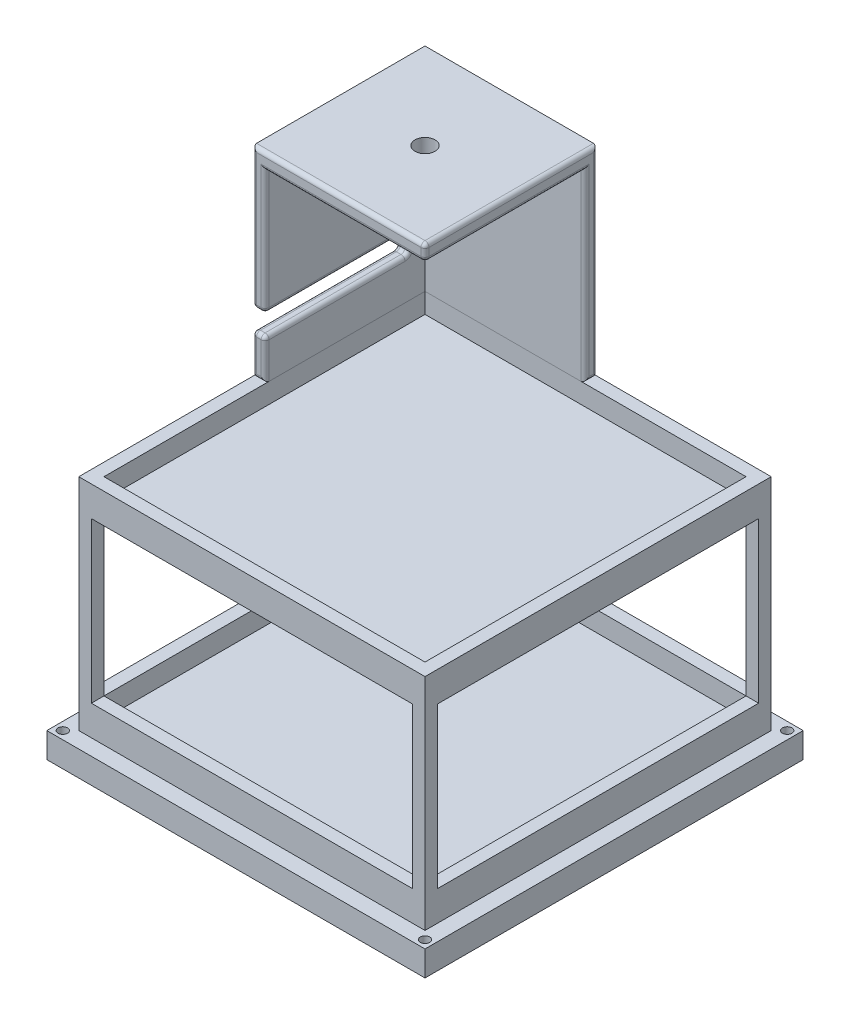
ISO-10303-21;
HEADER;
FILE_DESCRIPTION(('STEP AP214'),'2;1');
FILE_NAME('part.step','',(''),(''),'','','');
FILE_SCHEMA(('AUTOMOTIVE_DESIGN { 1 0 10303 214 1 1 1 1 }'));
ENDSEC;
DATA;
#1=APPLICATION_CONTEXT('core data for automotive mechanical design processes');
#2=APPLICATION_PROTOCOL_DEFINITION('international standard','automotive_design',2000,#1);
#3=PRODUCT_CONTEXT('',#1,'mechanical');
#4=PRODUCT('Part','Part','',(#3));
#5=PRODUCT_RELATED_PRODUCT_CATEGORY('part','',(#4));
#6=PRODUCT_DEFINITION_FORMATION('','',#4);
#7=PRODUCT_DEFINITION_CONTEXT('part definition',#1,'design');
#8=PRODUCT_DEFINITION('design','',#6,#7);
#9=PRODUCT_DEFINITION_SHAPE('','',#8);
#10=(LENGTH_UNIT() NAMED_UNIT(*) SI_UNIT(.MILLI.,.METRE.));
#11=(NAMED_UNIT(*) PLANE_ANGLE_UNIT() SI_UNIT($,.RADIAN.));
#12=(NAMED_UNIT(*) SI_UNIT($,.STERADIAN.) SOLID_ANGLE_UNIT());
#13=UNCERTAINTY_MEASURE_WITH_UNIT(LENGTH_MEASURE(1.E-05),#10,'distance_accuracy_value','');
#14=(GEOMETRIC_REPRESENTATION_CONTEXT(3) GLOBAL_UNCERTAINTY_ASSIGNED_CONTEXT((#13)) GLOBAL_UNIT_ASSIGNED_CONTEXT((#10,
#11,#12)) REPRESENTATION_CONTEXT('',''));
#15=CARTESIAN_POINT('',(0.,0.,0.));
#16=DIRECTION('',(0.,0.,1.));
#17=DIRECTION('',(1.,0.,0.));
#18=AXIS2_PLACEMENT_3D('',#15,#16,#17);
#19=CARTESIAN_POINT('',(-55.,133.35,-0.200000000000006));
#20=DIRECTION('',(0.,0.,-1.));
#21=DIRECTION('',(-1.,0.,0.));
#22=AXIS2_PLACEMENT_3D('',#19,#20,#21);
#23=PLANE('',#22);
#24=DIRECTION('',(-1.,0.,0.));
#25=VECTOR('',#24,1.);
#26=CARTESIAN_POINT('',(-55.,90.17,-0.200000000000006));
#27=LINE('',#26,#25);
#28=CARTESIAN_POINT('',(-53.73,90.17,-0.200000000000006));
#29=VERTEX_POINT('',#28);
#30=CARTESIAN_POINT('',(-52.27,90.17,-0.200000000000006));
#31=VERTEX_POINT('',#30);
#32=EDGE_CURVE('E307',#29,#31,#27,.F.);
#33=ORIENTED_EDGE('',*,*,#32,.T.);
#34=DIRECTION('',(0.,-1.,0.));
#35=VECTOR('',#34,1.);
#36=CARTESIAN_POINT('',(-52.27,133.35,-0.200000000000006));
#37=LINE('',#36,#35);
#38=CARTESIAN_POINT('',(-52.27,129.62,-0.200000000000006));
#39=VERTEX_POINT('',#38);
#40=EDGE_CURVE('E12',#31,#39,#37,.F.);
#41=ORIENTED_EDGE('',*,*,#40,.T.);
#42=DIRECTION('',(1.,0.,0.));
#43=VECTOR('',#42,1.);
#44=CARTESIAN_POINT('',(-55.,129.62,-0.200000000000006));
#45=LINE('',#44,#43);
#46=CARTESIAN_POINT('',(-1.47,129.62,-0.200000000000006));
#47=VERTEX_POINT('',#46);
#48=EDGE_CURVE('E66',#39,#47,#45,.T.);
#49=ORIENTED_EDGE('',*,*,#48,.T.);
#50=DIRECTION('',(0.,1.,0.));
#51=VECTOR('',#50,1.);
#52=CARTESIAN_POINT('',(-1.47,133.35,-0.200000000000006));
#53=LINE('',#52,#51);
#54=CARTESIAN_POINT('',(-1.47,132.08,-0.200000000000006));
#55=VERTEX_POINT('',#54);
#56=EDGE_CURVE('E431',#47,#55,#53,.T.);
#57=ORIENTED_EDGE('',*,*,#56,.T.);
#58=DIRECTION('',(1.,0.,0.));
#59=VECTOR('',#58,1.);
#60=CARTESIAN_POINT('',(-55.,132.08,-0.200000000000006));
#61=LINE('',#60,#59);
#62=CARTESIAN_POINT('',(-53.73,132.08,-0.200000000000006));
#63=VERTEX_POINT('',#62);
#64=EDGE_CURVE('E429',#55,#63,#61,.F.);
#65=ORIENTED_EDGE('',*,*,#64,.T.);
#66=DIRECTION('',(0.,-1.,0.));
#67=VECTOR('',#66,1.);
#68=CARTESIAN_POINT('',(-53.73,133.35,-0.200000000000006));
#69=LINE('',#68,#67);
#70=EDGE_CURVE('E427',#63,#29,#69,.T.);
#71=ORIENTED_EDGE('',*,*,#70,.T.);
#72=EDGE_LOOP('',(#33,#41,#49,#57,#65,#71));
#73=FACE_BOUND('',#72,.T.);
#74=ADVANCED_FACE('F57',(#73),#23,.F.);
#75=CARTESIAN_POINT('',(-51.,133.35,-0.200000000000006));
#76=DIRECTION('',(-1.,0.,0.));
#77=DIRECTION('',(0.,0.,1.));
#78=AXIS2_PLACEMENT_3D('',#75,#76,#77);
#79=PLANE('',#78);
#80=DIRECTION('',(0.,0.,1.));
#81=VECTOR('',#80,1.);
#82=CARTESIAN_POINT('',(-51.,81.28,-0.200000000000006));
#83=LINE('',#82,#81);
#84=CARTESIAN_POINT('',(-51.,81.28,-44.65));
#85=VERTEX_POINT('',#84);
#86=CARTESIAN_POINT('',(-51.,81.28,-1.47000000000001));
#87=VERTEX_POINT('',#86);
#88=EDGE_CURVE('E287',#85,#87,#83,.T.);
#89=ORIENTED_EDGE('',*,*,#88,.T.);
#90=DIRECTION('',(0.,-1.,0.));
#91=VECTOR('',#90,1.);
#92=CARTESIAN_POINT('',(-51.,133.35,-1.47000000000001));
#93=LINE('',#92,#91);
#94=CARTESIAN_POINT('',(-51.,69.85,-1.47000000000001));
#95=VERTEX_POINT('',#94);
#96=EDGE_CURVE('E402',#87,#95,#93,.T.);
#97=ORIENTED_EDGE('',*,*,#96,.T.);
#98=DIRECTION('',(0.,0.,-1.));
#99=VECTOR('',#98,1.);
#100=CARTESIAN_POINT('',(-51.,69.85,-0.200000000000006));
#101=LINE('',#100,#99);
#102=CARTESIAN_POINT('',(-51.,69.85,-51.));
#103=VERTEX_POINT('',#102);
#104=EDGE_CURVE('E259',#95,#103,#101,.T.);
#105=ORIENTED_EDGE('',*,*,#104,.T.);
#106=DIRECTION('',(0.,-1.,0.));
#107=VECTOR('',#106,1.);
#108=CARTESIAN_POINT('',(-51.,133.35,-51.));
#109=LINE('',#108,#107);
#110=CARTESIAN_POINT('',(-51.,128.35,-51.));
#111=VERTEX_POINT('',#110);
#112=EDGE_CURVE('E250',#111,#103,#109,.T.);
#113=ORIENTED_EDGE('',*,*,#112,.F.);
#114=DIRECTION('',(0.,0.,-1.));
#115=VECTOR('',#114,1.);
#116=CARTESIAN_POINT('',(-51.,128.35,-0.200000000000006));
#117=LINE('',#116,#115);
#118=CARTESIAN_POINT('',(-51.,128.35,-1.47000000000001));
#119=VERTEX_POINT('',#118);
#120=EDGE_CURVE('E234',#119,#111,#117,.T.);
#121=ORIENTED_EDGE('',*,*,#120,.F.);
#122=DIRECTION('',(0.,-1.,0.));
#123=VECTOR('',#122,1.);
#124=CARTESIAN_POINT('',(-51.,133.35,-1.47000000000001));
#125=LINE('',#124,#123);
#126=CARTESIAN_POINT('',(-51.,90.17,-1.47000000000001));
#127=VERTEX_POINT('',#126);
#128=EDGE_CURVE('E400',#119,#127,#125,.T.);
#129=ORIENTED_EDGE('',*,*,#128,.T.);
#130=DIRECTION('',(0.,0.,1.));
#131=VECTOR('',#130,1.);
#132=CARTESIAN_POINT('',(-51.,90.17,-0.200000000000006));
#133=LINE('',#132,#131);
#134=CARTESIAN_POINT('',(-51.,90.17,-44.65));
#135=VERTEX_POINT('',#134);
#136=EDGE_CURVE('E292',#127,#135,#133,.F.);
#137=ORIENTED_EDGE('',*,*,#136,.T.);
#138=CARTESIAN_POINT('',(-51.,87.63,-44.65));
#139=DIRECTION('',(-1.,0.,0.));
#140=DIRECTION('',(0.,0.,1.));
#141=AXIS2_PLACEMENT_3D('',#138,#139,#140);
#142=CIRCLE('',#141,2.54);
#143=CARTESIAN_POINT('',(-51.,87.63,-47.19));
#144=VERTEX_POINT('',#143);
#145=EDGE_CURVE('E289',#144,#135,#142,.F.);
#146=ORIENTED_EDGE('',*,*,#145,.F.);
#147=DIRECTION('',(0.,1.,0.));
#148=VECTOR('',#147,1.);
#149=CARTESIAN_POINT('',(-51.,82.55,-47.19));
#150=LINE('',#149,#148);
#151=CARTESIAN_POINT('',(-51.,83.82,-47.19));
#152=VERTEX_POINT('',#151);
#153=EDGE_CURVE('E285',#144,#152,#150,.F.);
#154=ORIENTED_EDGE('',*,*,#153,.T.);
#155=CARTESIAN_POINT('',(-51.,83.82,-44.65));
#156=DIRECTION('',(-1.,0.,0.));
#157=DIRECTION('',(0.,0.,1.));
#158=AXIS2_PLACEMENT_3D('',#155,#156,#157);
#159=CIRCLE('',#158,2.54);
#160=EDGE_CURVE('E282',#85,#152,#159,.F.);
#161=ORIENTED_EDGE('',*,*,#160,.F.);
#162=EDGE_LOOP('',(#89,#97,#105,#113,#121,#129,#137,#146,#154,#161));
#163=FACE_BOUND('',#162,.T.);
#164=ADVANCED_FACE('F257',(#163),#79,.F.);
#165=CARTESIAN_POINT('',(-51.,133.35,-51.));
#166=DIRECTION('',(0.,0.,-1.));
#167=DIRECTION('',(-1.,0.,0.));
#168=AXIS2_PLACEMENT_3D('',#165,#166,#167);
#169=PLANE('',#168);
#170=DIRECTION('',(1.,0.,0.));
#171=VECTOR('',#170,1.);
#172=CARTESIAN_POINT('',(-51.,69.85,-51.));
#173=LINE('',#172,#171);
#174=CARTESIAN_POINT('',(-1.47,69.85,-51.));
#175=VERTEX_POINT('',#174);
#176=EDGE_CURVE('E270',#103,#175,#173,.T.);
#177=ORIENTED_EDGE('',*,*,#176,.T.);
#178=DIRECTION('',(0.,-1.,0.));
#179=VECTOR('',#178,1.);
#180=CARTESIAN_POINT('',(-1.47,133.35,-51.));
#181=LINE('',#180,#179);
#182=CARTESIAN_POINT('',(-1.47,128.35,-51.));
#183=VERTEX_POINT('',#182);
#184=EDGE_CURVE('E253',#175,#183,#181,.F.);
#185=ORIENTED_EDGE('',*,*,#184,.T.);
#186=DIRECTION('',(1.,0.,0.));
#187=VECTOR('',#186,1.);
#188=CARTESIAN_POINT('',(-51.,128.35,-51.));
#189=LINE('',#188,#187);
#190=EDGE_CURVE('E237',#111,#183,#189,.T.);
#191=ORIENTED_EDGE('',*,*,#190,.F.);
#192=ORIENTED_EDGE('',*,*,#112,.T.);
#193=EDGE_LOOP('',(#177,#185,#191,#192));
#194=FACE_BOUND('',#193,.T.);
#195=ADVANCED_FACE('F249',(#194),#169,.F.);
#196=CARTESIAN_POINT('',(-0.199999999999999,133.35,-55.));
#197=DIRECTION('',(0.,0.,1.));
#198=DIRECTION('',(1.,0.,0.));
#199=AXIS2_PLACEMENT_3D('',#196,#197,#198);
#200=PLANE('',#199);
#201=DIRECTION('',(-1.,0.,0.));
#202=VECTOR('',#201,1.);
#203=CARTESIAN_POINT('',(-0.199999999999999,133.35,-55.));
#204=LINE('',#203,#202);
#205=CARTESIAN_POINT('',(-1.47,133.35,-55.));
#206=VERTEX_POINT('',#205);
#207=CARTESIAN_POINT('',(-55.,133.35,-55.));
#208=VERTEX_POINT('',#207);
#209=EDGE_CURVE('E267',#206,#208,#204,.T.);
#210=ORIENTED_EDGE('',*,*,#209,.F.);
#211=DIRECTION('',(0.,-1.,0.));
#212=VECTOR('',#211,1.);
#213=CARTESIAN_POINT('',(-1.47,133.35,-55.));
#214=LINE('',#213,#212);
#215=CARTESIAN_POINT('',(-1.47,69.85,-55.));
#216=VERTEX_POINT('',#215);
#217=EDGE_CURVE('E404',#206,#216,#214,.T.);
#218=ORIENTED_EDGE('',*,*,#217,.T.);
#219=DIRECTION('',(-1.,0.,0.));
#220=VECTOR('',#219,1.);
#221=CARTESIAN_POINT('',(-0.199999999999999,69.85,-55.));
#222=LINE('',#221,#220);
#223=CARTESIAN_POINT('',(-55.,69.85,-55.));
#224=VERTEX_POINT('',#223);
#225=EDGE_CURVE('E244',#216,#224,#222,.T.);
#226=ORIENTED_EDGE('',*,*,#225,.T.);
#227=DIRECTION('',(0.,-1.,0.));
#228=VECTOR('',#227,1.);
#229=CARTESIAN_POINT('',(-55.,133.35,-55.));
#230=LINE('',#229,#228);
#231=EDGE_CURVE('E260',#208,#224,#230,.T.);
#232=ORIENTED_EDGE('',*,*,#231,.F.);
#233=EDGE_LOOP('',(#210,#218,#226,#232));
#234=FACE_BOUND('',#233,.T.);
#235=ADVANCED_FACE('F557',(#234),#200,.F.);
#236=CARTESIAN_POINT('',(-55.,133.35,-55.));
#237=DIRECTION('',(1.,0.,0.));
#238=DIRECTION('',(0.,0.,-1.));
#239=AXIS2_PLACEMENT_3D('',#236,#237,#238);
#240=PLANE('',#239);
#241=DIRECTION('',(0.,0.,1.));
#242=VECTOR('',#241,1.);
#243=CARTESIAN_POINT('',(-55.,69.85,-55.));
#244=LINE('',#243,#242);
#245=CARTESIAN_POINT('',(-55.,69.85,-1.47000000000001));
#246=VERTEX_POINT('',#245);
#247=EDGE_CURVE('E572',#224,#246,#244,.T.);
#248=ORIENTED_EDGE('',*,*,#247,.T.);
#249=DIRECTION('',(0.,-1.,0.));
#250=VECTOR('',#249,1.);
#251=CARTESIAN_POINT('',(-55.,133.35,-1.47000000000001));
#252=LINE('',#251,#250);
#253=CARTESIAN_POINT('',(-55.,81.28,-1.47000000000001));
#254=VERTEX_POINT('',#253);
#255=EDGE_CURVE('E398',#246,#254,#252,.F.);
#256=ORIENTED_EDGE('',*,*,#255,.T.);
#257=DIRECTION('',(0.,0.,1.));
#258=VECTOR('',#257,1.);
#259=CARTESIAN_POINT('',(-55.,81.28,-55.));
#260=LINE('',#259,#258);
#261=CARTESIAN_POINT('',(-55.,81.28,-44.65));
#262=VERTEX_POINT('',#261);
#263=EDGE_CURVE('E302',#254,#262,#260,.F.);
#264=ORIENTED_EDGE('',*,*,#263,.T.);
#265=CARTESIAN_POINT('',(-55.,83.82,-44.65));
#266=DIRECTION('',(1.,0.,0.));
#267=DIRECTION('',(0.,0.,-1.));
#268=AXIS2_PLACEMENT_3D('',#265,#266,#267);
#269=CIRCLE('',#268,2.54);
#270=CARTESIAN_POINT('',(-55.,83.82,-47.19));
#271=VERTEX_POINT('',#270);
#272=EDGE_CURVE('E299',#271,#262,#269,.F.);
#273=ORIENTED_EDGE('',*,*,#272,.F.);
#274=DIRECTION('',(0.,-1.,0.));
#275=VECTOR('',#274,1.);
#276=CARTESIAN_POINT('',(-55.,88.9,-47.19));
#277=LINE('',#276,#275);
#278=CARTESIAN_POINT('',(-55.,87.63,-47.19));
#279=VERTEX_POINT('',#278);
#280=EDGE_CURVE('E297',#271,#279,#277,.F.);
#281=ORIENTED_EDGE('',*,*,#280,.T.);
#282=CARTESIAN_POINT('',(-55.,87.63,-44.65));
#283=DIRECTION('',(1.,0.,0.));
#284=DIRECTION('',(0.,0.,-1.));
#285=AXIS2_PLACEMENT_3D('',#282,#283,#284);
#286=CIRCLE('',#285,2.54);
#287=CARTESIAN_POINT('',(-55.,90.17,-44.65));
#288=VERTEX_POINT('',#287);
#289=EDGE_CURVE('E294',#288,#279,#286,.F.);
#290=ORIENTED_EDGE('',*,*,#289,.F.);
#291=DIRECTION('',(0.,0.,1.));
#292=VECTOR('',#291,1.);
#293=CARTESIAN_POINT('',(-55.,90.17,-55.));
#294=LINE('',#293,#292);
#295=CARTESIAN_POINT('',(-55.,90.17,-1.47000000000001));
#296=VERTEX_POINT('',#295);
#297=EDGE_CURVE('E304',#288,#296,#294,.T.);
#298=ORIENTED_EDGE('',*,*,#297,.T.);
#299=DIRECTION('',(0.,-1.,0.));
#300=VECTOR('',#299,1.);
#301=CARTESIAN_POINT('',(-55.,133.35,-1.47000000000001));
#302=LINE('',#301,#300);
#303=CARTESIAN_POINT('',(-55.,133.35,-1.47000000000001));
#304=VERTEX_POINT('',#303);
#305=EDGE_CURVE('E396',#296,#304,#302,.F.);
#306=ORIENTED_EDGE('',*,*,#305,.T.);
#307=DIRECTION('',(0.,0.,1.));
#308=VECTOR('',#307,1.);
#309=CARTESIAN_POINT('',(-55.,133.35,-55.));
#310=LINE('',#309,#308);
#311=EDGE_CURVE('E261',#208,#304,#310,.T.);
#312=ORIENTED_EDGE('',*,*,#311,.F.);
#313=ORIENTED_EDGE('',*,*,#231,.T.);
#314=EDGE_LOOP('',(#248,#256,#264,#273,#281,#290,#298,#306,#312,#313));
#315=FACE_BOUND('',#314,.T.);
#316=ADVANCED_FACE('F606',(#315),#240,.F.);
#317=DIRECTION('',(1.,0.,0.));
#318=VECTOR('',#317,1.);
#319=CARTESIAN_POINT('',(-55.,81.28,-0.200000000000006));
#320=LINE('',#319,#318);
#321=CARTESIAN_POINT('',(-52.27,81.28,-0.200000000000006));
#322=VERTEX_POINT('',#321);
#323=CARTESIAN_POINT('',(-53.73,81.28,-0.200000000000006));
#324=VERTEX_POINT('',#323);
#325=EDGE_CURVE('E319',#322,#324,#320,.F.);
#326=ORIENTED_EDGE('',*,*,#325,.T.);
#327=DIRECTION('',(0.,-1.,0.));
#328=VECTOR('',#327,1.);
#329=CARTESIAN_POINT('',(-53.73,133.35,-0.200000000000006));
#330=LINE('',#329,#328);
#331=CARTESIAN_POINT('',(-53.73,71.12,-0.200000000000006));
#332=VERTEX_POINT('',#331);
#333=EDGE_CURVE('E390',#324,#332,#330,.T.);
#334=ORIENTED_EDGE('',*,*,#333,.T.);
#335=DIRECTION('',(1.,0.,0.));
#336=VECTOR('',#335,1.);
#337=CARTESIAN_POINT('',(-55.,71.12,-0.200000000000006));
#338=LINE('',#337,#336);
#339=CARTESIAN_POINT('',(-52.27,71.12,-0.200000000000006));
#340=VERTEX_POINT('',#339);
#341=EDGE_CURVE('E388',#332,#340,#338,.T.);
#342=ORIENTED_EDGE('',*,*,#341,.T.);
#343=DIRECTION('',(0.,-1.,0.));
#344=VECTOR('',#343,1.);
#345=CARTESIAN_POINT('',(-52.27,133.35,-0.200000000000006));
#346=LINE('',#345,#344);
#347=EDGE_CURVE('E386',#340,#322,#346,.F.);
#348=ORIENTED_EDGE('',*,*,#347,.T.);
#349=EDGE_LOOP('',(#326,#334,#342,#348));
#350=FACE_BOUND('',#349,.T.);
#351=ADVANCED_FACE('F593',(#350),#23,.F.);
#352=CARTESIAN_POINT('',(-0.199999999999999,133.35,-51.));
#353=DIRECTION('',(-1.,0.,0.));
#354=DIRECTION('',(0.,0.,1.));
#355=AXIS2_PLACEMENT_3D('',#352,#353,#354);
#356=PLANE('',#355);
#357=DIRECTION('',(0.,0.,-1.));
#358=VECTOR('',#357,1.);
#359=CARTESIAN_POINT('',(-0.199999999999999,71.12,-51.));
#360=LINE('',#359,#358);
#361=CARTESIAN_POINT('',(-0.199999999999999,71.12,-52.27));
#362=VERTEX_POINT('',#361);
#363=CARTESIAN_POINT('',(-0.199999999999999,71.12,-53.73));
#364=VERTEX_POINT('',#363);
#365=EDGE_CURVE('E414',#362,#364,#360,.T.);
#366=ORIENTED_EDGE('',*,*,#365,.T.);
#367=DIRECTION('',(0.,-1.,0.));
#368=VECTOR('',#367,1.);
#369=CARTESIAN_POINT('',(-0.199999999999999,133.35,-53.73));
#370=LINE('',#369,#368);
#371=CARTESIAN_POINT('',(-0.199999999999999,132.08,-53.73));
#372=VERTEX_POINT('',#371);
#373=EDGE_CURVE('E416',#364,#372,#370,.F.);
#374=ORIENTED_EDGE('',*,*,#373,.T.);
#375=DIRECTION('',(0.,0.,-1.));
#376=VECTOR('',#375,1.);
#377=CARTESIAN_POINT('',(-0.199999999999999,132.08,-0.200000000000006));
#378=LINE('',#377,#376);
#379=CARTESIAN_POINT('',(-0.199999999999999,132.08,-1.47000000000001));
#380=VERTEX_POINT('',#379);
#381=EDGE_CURVE('E408',#372,#380,#378,.F.);
#382=ORIENTED_EDGE('',*,*,#381,.T.);
#383=DIRECTION('',(0.,1.,0.));
#384=VECTOR('',#383,1.);
#385=CARTESIAN_POINT('',(-0.199999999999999,133.35,-1.47000000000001));
#386=LINE('',#385,#384);
#387=CARTESIAN_POINT('',(-0.199999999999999,129.62,-1.47000000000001));
#388=VERTEX_POINT('',#387);
#389=EDGE_CURVE('E406',#380,#388,#386,.F.);
#390=ORIENTED_EDGE('',*,*,#389,.T.);
#391=DIRECTION('',(0.,0.,-1.));
#392=VECTOR('',#391,1.);
#393=CARTESIAN_POINT('',(-0.199999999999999,129.62,-51.));
#394=LINE('',#393,#392);
#395=CARTESIAN_POINT('',(-0.199999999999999,129.62,-52.27));
#396=VERTEX_POINT('',#395);
#397=EDGE_CURVE('E410',#388,#396,#394,.T.);
#398=ORIENTED_EDGE('',*,*,#397,.T.);
#399=DIRECTION('',(0.,-1.,0.));
#400=VECTOR('',#399,1.);
#401=CARTESIAN_POINT('',(-0.199999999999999,133.35,-52.27));
#402=LINE('',#401,#400);
#403=EDGE_CURVE('E412',#396,#362,#402,.T.);
#404=ORIENTED_EDGE('',*,*,#403,.T.);
#405=EDGE_LOOP('',(#366,#374,#382,#390,#398,#404));
#406=FACE_BOUND('',#405,.T.);
#407=ADVANCED_FACE('F586',(#406),#356,.F.);
#408=CARTESIAN_POINT('',(0.,133.35,0.));
#409=DIRECTION('',(0.,1.,0.));
#410=DIRECTION('',(0.,0.,1.));
#411=AXIS2_PLACEMENT_3D('',#408,#409,#410);
#412=PLANE('',#411);
#413=CARTESIAN_POINT('',(-27.6,133.35,-27.6));
#414=DIRECTION('',(0.,1.,0.));
#415=DIRECTION('',(0.,0.,1.));
#416=AXIS2_PLACEMENT_3D('',#413,#414,#415);
#417=CIRCLE('',#416,3.175);
#418=CARTESIAN_POINT('',(-27.6,133.35,-24.425));
#419=VERTEX_POINT('',#418);
#420=EDGE_CURVE('E368',#419,#419,#417,.T.);
#421=ORIENTED_EDGE('',*,*,#420,.F.);
#422=EDGE_LOOP('',(#421));
#423=FACE_BOUND('',#422,.T.);
#424=DIRECTION('',(1.,0.,0.));
#425=VECTOR('',#424,1.);
#426=CARTESIAN_POINT('',(-0.199999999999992,133.35,-1.47000000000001));
#427=LINE('',#426,#425);
#428=CARTESIAN_POINT('',(-1.47,133.35,-1.47000000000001));
#429=VERTEX_POINT('',#428);
#430=EDGE_CURVE('E423',#304,#429,#427,.T.);
#431=ORIENTED_EDGE('',*,*,#430,.T.);
#432=DIRECTION('',(0.,0.,-1.));
#433=VECTOR('',#432,1.);
#434=CARTESIAN_POINT('',(-1.47,133.35,-55.));
#435=LINE('',#434,#433);
#436=EDGE_CURVE('E425',#429,#206,#435,.T.);
#437=ORIENTED_EDGE('',*,*,#436,.T.);
#438=ORIENTED_EDGE('',*,*,#209,.T.);
#439=ORIENTED_EDGE('',*,*,#311,.T.);
#440=EDGE_LOOP('',(#431,#437,#438,#439));
#441=FACE_BOUND('',#440,.T.);
#442=ADVANCED_FACE('F552',(#423,#441),#412,.T.);
#443=CARTESIAN_POINT('',(0.,69.85,0.));
#444=DIRECTION('',(0.,1.,0.));
#445=DIRECTION('',(0.,0.,1.));
#446=AXIS2_PLACEMENT_3D('',#443,#444,#445);
#447=PLANE('',#446);
#448=ORIENTED_EDGE('',*,*,#104,.F.);
#449=DIRECTION('',(1.,0.,0.));
#450=VECTOR('',#449,1.);
#451=CARTESIAN_POINT('',(0.,69.85,-1.47000000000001));
#452=LINE('',#451,#450);
#453=EDGE_CURVE('E394',#95,#246,#452,.F.);
#454=ORIENTED_EDGE('',*,*,#453,.T.);
#455=ORIENTED_EDGE('',*,*,#247,.F.);
#456=ORIENTED_EDGE('',*,*,#225,.F.);
#457=DIRECTION('',(0.,0.,-1.));
#458=VECTOR('',#457,1.);
#459=CARTESIAN_POINT('',(-1.47,69.85,0.));
#460=LINE('',#459,#458);
#461=EDGE_CURVE('E392',#216,#175,#460,.F.);
#462=ORIENTED_EDGE('',*,*,#461,.T.);
#463=ORIENTED_EDGE('',*,*,#176,.F.);
#464=EDGE_LOOP('',(#448,#454,#455,#456,#462,#463));
#465=FACE_BOUND('',#464,.T.);
#466=ADVANCED_FACE('F570',(#465),#447,.F.);
#467=CARTESIAN_POINT('',(0.,128.35,0.));
#468=DIRECTION('',(0.,1.,0.));
#469=DIRECTION('',(0.,0.,1.));
#470=AXIS2_PLACEMENT_3D('',#467,#468,#469);
#471=PLANE('',#470);
#472=CARTESIAN_POINT('',(-27.6,128.35,-27.6));
#473=DIRECTION('',(0.,1.,0.));
#474=DIRECTION('',(0.,0.,1.));
#475=AXIS2_PLACEMENT_3D('',#472,#473,#474);
#476=CIRCLE('',#475,3.175);
#477=CARTESIAN_POINT('',(-27.6,128.35,-24.425));
#478=VERTEX_POINT('',#477);
#479=EDGE_CURVE('E254',#478,#478,#476,.F.);
#480=ORIENTED_EDGE('',*,*,#479,.F.);
#481=EDGE_LOOP('',(#480));
#482=FACE_BOUND('',#481,.T.);
#483=ORIENTED_EDGE('',*,*,#190,.T.);
#484=DIRECTION('',(0.,0.,-1.));
#485=VECTOR('',#484,1.);
#486=CARTESIAN_POINT('',(-1.47,128.35,0.));
#487=LINE('',#486,#485);
#488=CARTESIAN_POINT('',(-1.47,128.35,-1.47000000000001));
#489=VERTEX_POINT('',#488);
#490=EDGE_CURVE('E421',#183,#489,#487,.F.);
#491=ORIENTED_EDGE('',*,*,#490,.T.);
#492=DIRECTION('',(1.,0.,0.));
#493=VECTOR('',#492,1.);
#494=CARTESIAN_POINT('',(0.,128.35,-1.47000000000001));
#495=LINE('',#494,#493);
#496=EDGE_CURVE('E240',#489,#119,#495,.F.);
#497=ORIENTED_EDGE('',*,*,#496,.T.);
#498=ORIENTED_EDGE('',*,*,#120,.T.);
#499=EDGE_LOOP('',(#483,#491,#497,#498));
#500=FACE_BOUND('',#499,.T.);
#501=ADVANCED_FACE('F236',(#482,#500),#471,.F.);
#502=CARTESIAN_POINT('',(-27.6,-8.00100000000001,-27.6));
#503=DIRECTION('',(0.,1.,0.));
#504=DIRECTION('',(0.,0.,1.));
#505=AXIS2_PLACEMENT_3D('',#502,#503,#504);
#506=CYLINDRICAL_SURFACE('',#505,3.175);
#507=ORIENTED_EDGE('',*,*,#420,.T.);
#508=EDGE_LOOP('',(#507));
#509=FACE_BOUND('',#508,.T.);
#510=ORIENTED_EDGE('',*,*,#479,.T.);
#511=EDGE_LOOP('',(#510));
#512=FACE_BOUND('',#511,.T.);
#513=ADVANCED_FACE('F582',(#509,#512),#506,.F.);
#514=CARTESIAN_POINT('',(-55.,88.9,-45.92));
#515=DIRECTION('',(0.,1.,0.));
#516=DIRECTION('',(0.,0.,1.));
#517=AXIS2_PLACEMENT_3D('',#514,#515,#516);
#518=PLANE('',#517);
#519=DIRECTION('',(0.,0.,1.));
#520=VECTOR('',#519,1.);
#521=CARTESIAN_POINT('',(-52.27,88.9,-45.92));
#522=LINE('',#521,#520);
#523=CARTESIAN_POINT('',(-52.27,88.9,-44.65));
#524=VERTEX_POINT('',#523);
#525=CARTESIAN_POINT('',(-52.27,88.9,-1.47000000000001));
#526=VERTEX_POINT('',#525);
#527=EDGE_CURVE('E276',#524,#526,#522,.T.);
#528=ORIENTED_EDGE('',*,*,#527,.T.);
#529=DIRECTION('',(-1.,0.,0.));
#530=VECTOR('',#529,1.);
#531=CARTESIAN_POINT('',(-55.,88.9,-1.47000000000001));
#532=LINE('',#531,#530);
#533=CARTESIAN_POINT('',(-53.73,88.9,-1.47000000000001));
#534=VERTEX_POINT('',#533);
#535=EDGE_CURVE('E279',#526,#534,#532,.T.);
#536=ORIENTED_EDGE('',*,*,#535,.T.);
#537=DIRECTION('',(0.,0.,1.));
#538=VECTOR('',#537,1.);
#539=CARTESIAN_POINT('',(-53.73,88.9,-45.92));
#540=LINE('',#539,#538);
#541=CARTESIAN_POINT('',(-53.73,88.9,-44.65));
#542=VERTEX_POINT('',#541);
#543=EDGE_CURVE('E274',#534,#542,#540,.F.);
#544=ORIENTED_EDGE('',*,*,#543,.T.);
#545=DIRECTION('',(-1.,0.,0.));
#546=VECTOR('',#545,1.);
#547=CARTESIAN_POINT('',(-55.,88.9,-44.65));
#548=LINE('',#547,#546);
#549=EDGE_CURVE('E264',#542,#524,#548,.F.);
#550=ORIENTED_EDGE('',*,*,#549,.T.);
#551=EDGE_LOOP('',(#528,#536,#544,#550));
#552=FACE_BOUND('',#551,.T.);
#553=ADVANCED_FACE('F500',(#552),#518,.F.);
#554=CARTESIAN_POINT('',(-55.,82.55,-45.92));
#555=DIRECTION('',(0.,-1.,0.));
#556=DIRECTION('',(0.,0.,-1.));
#557=AXIS2_PLACEMENT_3D('',#554,#555,#556);
#558=PLANE('',#557);
#559=DIRECTION('',(0.,0.,1.));
#560=VECTOR('',#559,1.);
#561=CARTESIAN_POINT('',(-53.73,82.55,-45.92));
#562=LINE('',#561,#560);
#563=CARTESIAN_POINT('',(-53.73,82.55,-44.65));
#564=VERTEX_POINT('',#563);
#565=CARTESIAN_POINT('',(-53.73,82.55,-1.47000000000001));
#566=VERTEX_POINT('',#565);
#567=EDGE_CURVE('E313',#564,#566,#562,.T.);
#568=ORIENTED_EDGE('',*,*,#567,.T.);
#569=DIRECTION('',(1.,0.,0.));
#570=VECTOR('',#569,1.);
#571=CARTESIAN_POINT('',(-55.,82.55,-1.47000000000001));
#572=LINE('',#571,#570);
#573=CARTESIAN_POINT('',(-52.27,82.55,-1.47000000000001));
#574=VERTEX_POINT('',#573);
#575=EDGE_CURVE('E316',#566,#574,#572,.T.);
#576=ORIENTED_EDGE('',*,*,#575,.T.);
#577=DIRECTION('',(0.,0.,1.));
#578=VECTOR('',#577,1.);
#579=CARTESIAN_POINT('',(-52.27,82.55,-45.92));
#580=LINE('',#579,#578);
#581=CARTESIAN_POINT('',(-52.27,82.55,-44.65));
#582=VERTEX_POINT('',#581);
#583=EDGE_CURVE('E311',#574,#582,#580,.F.);
#584=ORIENTED_EDGE('',*,*,#583,.T.);
#585=DIRECTION('',(1.,0.,0.));
#586=VECTOR('',#585,1.);
#587=CARTESIAN_POINT('',(-55.,82.55,-44.65));
#588=LINE('',#587,#586);
#589=EDGE_CURVE('E309',#582,#564,#588,.F.);
#590=ORIENTED_EDGE('',*,*,#589,.T.);
#591=EDGE_LOOP('',(#568,#576,#584,#590));
#592=FACE_BOUND('',#591,.T.);
#593=ADVANCED_FACE('F648',(#592),#558,.F.);
#594=CARTESIAN_POINT('',(0.,0.,-45.92));
#595=DIRECTION('',(0.,0.,1.));
#596=DIRECTION('',(1.,0.,0.));
#597=AXIS2_PLACEMENT_3D('',#594,#595,#596);
#598=PLANE('',#597);
#599=DIRECTION('',(0.,1.,0.));
#600=VECTOR('',#599,1.);
#601=CARTESIAN_POINT('',(-52.27,88.9,-45.92));
#602=LINE('',#601,#600);
#603=CARTESIAN_POINT('',(-52.27,83.82,-45.92));
#604=VERTEX_POINT('',#603);
#605=CARTESIAN_POINT('',(-52.27,87.63,-45.92));
#606=VERTEX_POINT('',#605);
#607=EDGE_CURVE('E326',#604,#606,#602,.T.);
#608=ORIENTED_EDGE('',*,*,#607,.T.);
#609=DIRECTION('',(-1.,0.,0.));
#610=VECTOR('',#609,1.);
#611=CARTESIAN_POINT('',(0.,87.63,-45.92));
#612=LINE('',#611,#610);
#613=CARTESIAN_POINT('',(-53.73,87.63,-45.92));
#614=VERTEX_POINT('',#613);
#615=EDGE_CURVE('E328',#606,#614,#612,.T.);
#616=ORIENTED_EDGE('',*,*,#615,.T.);
#617=DIRECTION('',(0.,-1.,0.));
#618=VECTOR('',#617,1.);
#619=CARTESIAN_POINT('',(-53.73,82.55,-45.92));
#620=LINE('',#619,#618);
#621=CARTESIAN_POINT('',(-53.73,83.82,-45.92));
#622=VERTEX_POINT('',#621);
#623=EDGE_CURVE('E322',#614,#622,#620,.T.);
#624=ORIENTED_EDGE('',*,*,#623,.T.);
#625=DIRECTION('',(1.,0.,0.));
#626=VECTOR('',#625,1.);
#627=CARTESIAN_POINT('',(0.,83.82,-45.92));
#628=LINE('',#627,#626);
#629=EDGE_CURVE('E324',#622,#604,#628,.T.);
#630=ORIENTED_EDGE('',*,*,#629,.T.);
#631=EDGE_LOOP('',(#608,#616,#624,#630));
#632=FACE_BOUND('',#631,.T.);
#633=ADVANCED_FACE('F666',(#632),#598,.T.);
#634=CARTESIAN_POINT('',(-53.73,81.28,-45.92));
#635=DIRECTION('',(0.,0.,1.));
#636=DIRECTION('',(1.,0.,0.));
#637=AXIS2_PLACEMENT_3D('',#634,#635,#636);
#638=CYLINDRICAL_SURFACE('',#637,1.27);
#639=ORIENTED_EDGE('',*,*,#263,.F.);
#640=CARTESIAN_POINT('',(-53.73,81.28,-1.47000000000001));
#641=DIRECTION('',(0.,0.,1.));
#642=DIRECTION('',(1.,0.,0.));
#643=AXIS2_PLACEMENT_3D('',#640,#641,#642);
#644=CIRCLE('',#643,1.27);
#645=EDGE_CURVE('E373',#254,#566,#644,.F.);
#646=ORIENTED_EDGE('',*,*,#645,.T.);
#647=ORIENTED_EDGE('',*,*,#567,.F.);
#648=CARTESIAN_POINT('',(-53.73,81.28,-44.65));
#649=DIRECTION('',(0.,0.,-1.));
#650=DIRECTION('',(-1.,0.,0.));
#651=AXIS2_PLACEMENT_3D('',#648,#649,#650);
#652=CIRCLE('',#651,1.27);
#653=EDGE_CURVE('E365',#262,#564,#652,.T.);
#654=ORIENTED_EDGE('',*,*,#653,.F.);
#655=EDGE_LOOP('',(#639,#646,#647,#654));
#656=FACE_BOUND('',#655,.T.);
#657=ADVANCED_FACE('F644',(#656),#638,.T.);
#658=CARTESIAN_POINT('',(-55.,81.28,-1.47000000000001));
#659=DIRECTION('',(1.,0.,0.));
#660=DIRECTION('',(0.,0.,-1.));
#661=AXIS2_PLACEMENT_3D('',#658,#659,#660);
#662=CYLINDRICAL_SURFACE('',#661,1.27);
#663=ORIENTED_EDGE('',*,*,#575,.F.);
#664=CARTESIAN_POINT('',(-53.73,81.28,-1.47000000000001));
#665=DIRECTION('',(1.,0.,0.));
#666=DIRECTION('',(0.,0.,-1.));
#667=AXIS2_PLACEMENT_3D('',#664,#665,#666);
#668=CIRCLE('',#667,1.27);
#669=EDGE_CURVE('E370',#566,#324,#668,.T.);
#670=ORIENTED_EDGE('',*,*,#669,.T.);
#671=ORIENTED_EDGE('',*,*,#325,.F.);
#672=CARTESIAN_POINT('',(-52.27,81.28,-1.47000000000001));
#673=DIRECTION('',(1.,0.,0.));
#674=DIRECTION('',(0.,0.,-1.));
#675=AXIS2_PLACEMENT_3D('',#672,#673,#674);
#676=CIRCLE('',#675,1.27);
#677=EDGE_CURVE('E331',#322,#574,#676,.F.);
#678=ORIENTED_EDGE('',*,*,#677,.T.);
#679=EDGE_LOOP('',(#663,#670,#671,#678));
#680=FACE_BOUND('',#679,.T.);
#681=ADVANCED_FACE('F619',(#680),#662,.T.);
#682=CARTESIAN_POINT('',(-53.73,83.82,-44.65));
#683=DIRECTION('',(1.,0.,0.));
#684=DIRECTION('',(0.,0.,-1.));
#685=AXIS2_PLACEMENT_3D('',#682,#683,#684);
#686=TOROIDAL_SURFACE('',#685,2.54,1.27);
#687=ORIENTED_EDGE('',*,*,#272,.T.);
#688=ORIENTED_EDGE('',*,*,#653,.T.);
#689=CARTESIAN_POINT('',(-53.73,83.82,-44.65));
#690=DIRECTION('',(1.,0.,0.));
#691=DIRECTION('',(0.,0.,-1.));
#692=AXIS2_PLACEMENT_3D('',#689,#690,#691);
#693=CIRCLE('',#692,1.27);
#694=EDGE_CURVE('E362',#622,#564,#693,.F.);
#695=ORIENTED_EDGE('',*,*,#694,.F.);
#696=CARTESIAN_POINT('',(-53.73,83.82,-47.19));
#697=DIRECTION('',(0.,-1.,0.));
#698=DIRECTION('',(0.,0.,-1.));
#699=AXIS2_PLACEMENT_3D('',#696,#697,#698);
#700=CIRCLE('',#699,1.27);
#701=EDGE_CURVE('E359',#271,#622,#700,.F.);
#702=ORIENTED_EDGE('',*,*,#701,.F.);
#703=EDGE_LOOP('',(#687,#688,#695,#702));
#704=FACE_BOUND('',#703,.T.);
#705=ADVANCED_FACE('F672',(#704),#686,.T.);
#706=CARTESIAN_POINT('',(-52.27,81.28,-0.200000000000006));
#707=DIRECTION('',(0.,0.,1.));
#708=DIRECTION('',(1.,0.,0.));
#709=AXIS2_PLACEMENT_3D('',#706,#707,#708);
#710=CYLINDRICAL_SURFACE('',#709,1.27);
#711=ORIENTED_EDGE('',*,*,#583,.F.);
#712=CARTESIAN_POINT('',(-52.27,81.28,-1.47000000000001));
#713=DIRECTION('',(0.,0.,1.));
#714=DIRECTION('',(1.,0.,0.));
#715=AXIS2_PLACEMENT_3D('',#712,#713,#714);
#716=CIRCLE('',#715,1.27);
#717=EDGE_CURVE('E375',#574,#87,#716,.F.);
#718=ORIENTED_EDGE('',*,*,#717,.T.);
#719=ORIENTED_EDGE('',*,*,#88,.F.);
#720=CARTESIAN_POINT('',(-52.27,81.28,-44.65));
#721=DIRECTION('',(0.,0.,-1.));
#722=DIRECTION('',(-1.,0.,0.));
#723=AXIS2_PLACEMENT_3D('',#720,#721,#722);
#724=CIRCLE('',#723,1.27);
#725=EDGE_CURVE('E356',#582,#85,#724,.T.);
#726=ORIENTED_EDGE('',*,*,#725,.F.);
#727=EDGE_LOOP('',(#711,#718,#719,#726));
#728=FACE_BOUND('',#727,.T.);
#729=ADVANCED_FACE('F658',(#728),#710,.T.);
#730=CARTESIAN_POINT('',(0.,83.82,-44.65));
#731=DIRECTION('',(1.,0.,0.));
#732=DIRECTION('',(0.,0.,-1.));
#733=AXIS2_PLACEMENT_3D('',#730,#731,#732);
#734=CYLINDRICAL_SURFACE('',#733,1.27);
#735=ORIENTED_EDGE('',*,*,#694,.T.);
#736=ORIENTED_EDGE('',*,*,#589,.F.);
#737=CARTESIAN_POINT('',(-52.27,83.82,-44.65));
#738=DIRECTION('',(-1.,0.,0.));
#739=DIRECTION('',(0.,0.,1.));
#740=AXIS2_PLACEMENT_3D('',#737,#738,#739);
#741=CIRCLE('',#740,1.27);
#742=EDGE_CURVE('E353',#604,#582,#741,.T.);
#743=ORIENTED_EDGE('',*,*,#742,.F.);
#744=ORIENTED_EDGE('',*,*,#629,.F.);
#745=EDGE_LOOP('',(#735,#736,#743,#744));
#746=FACE_BOUND('',#745,.T.);
#747=ADVANCED_FACE('F653',(#746),#734,.F.);
#748=CARTESIAN_POINT('',(-53.73,0.,-47.19));
#749=DIRECTION('',(0.,1.,0.));
#750=DIRECTION('',(0.,0.,1.));
#751=AXIS2_PLACEMENT_3D('',#748,#749,#750);
#752=CYLINDRICAL_SURFACE('',#751,1.27);
#753=ORIENTED_EDGE('',*,*,#701,.T.);
#754=ORIENTED_EDGE('',*,*,#623,.F.);
#755=CARTESIAN_POINT('',(-53.73,87.63,-47.19));
#756=DIRECTION('',(0.,1.,0.));
#757=DIRECTION('',(0.,0.,1.));
#758=AXIS2_PLACEMENT_3D('',#755,#756,#757);
#759=CIRCLE('',#758,1.27);
#760=EDGE_CURVE('E350',#279,#614,#759,.T.);
#761=ORIENTED_EDGE('',*,*,#760,.F.);
#762=ORIENTED_EDGE('',*,*,#280,.F.);
#763=EDGE_LOOP('',(#753,#754,#761,#762));
#764=FACE_BOUND('',#763,.T.);
#765=ADVANCED_FACE('F670',(#764),#752,.T.);
#766=CARTESIAN_POINT('',(-52.27,83.82,-44.65));
#767=DIRECTION('',(-1.,0.,0.));
#768=DIRECTION('',(0.,0.,1.));
#769=AXIS2_PLACEMENT_3D('',#766,#767,#768);
#770=TOROIDAL_SURFACE('',#769,2.54,1.27);
#771=ORIENTED_EDGE('',*,*,#725,.T.);
#772=ORIENTED_EDGE('',*,*,#160,.T.);
#773=CARTESIAN_POINT('',(-52.27,83.82,-47.19));
#774=DIRECTION('',(0.,-1.,0.));
#775=DIRECTION('',(0.,0.,-1.));
#776=AXIS2_PLACEMENT_3D('',#773,#774,#775);
#777=CIRCLE('',#776,1.27);
#778=EDGE_CURVE('E347',#604,#152,#777,.F.);
#779=ORIENTED_EDGE('',*,*,#778,.F.);
#780=ORIENTED_EDGE('',*,*,#742,.T.);
#781=EDGE_LOOP('',(#771,#772,#779,#780));
#782=FACE_BOUND('',#781,.T.);
#783=ADVANCED_FACE('F660',(#782),#770,.T.);
#784=CARTESIAN_POINT('',(-53.73,87.63,-44.65));
#785=DIRECTION('',(1.,0.,0.));
#786=DIRECTION('',(0.,0.,-1.));
#787=AXIS2_PLACEMENT_3D('',#784,#785,#786);
#788=TOROIDAL_SURFACE('',#787,2.54,1.27);
#789=ORIENTED_EDGE('',*,*,#289,.T.);
#790=ORIENTED_EDGE('',*,*,#760,.T.);
#791=CARTESIAN_POINT('',(-53.73,87.63,-44.65));
#792=DIRECTION('',(1.,0.,0.));
#793=DIRECTION('',(0.,0.,-1.));
#794=AXIS2_PLACEMENT_3D('',#791,#792,#793);
#795=CIRCLE('',#794,1.27);
#796=EDGE_CURVE('E345',#542,#614,#795,.F.);
#797=ORIENTED_EDGE('',*,*,#796,.F.);
#798=CARTESIAN_POINT('',(-53.73,90.17,-44.65));
#799=DIRECTION('',(0.,0.,-1.));
#800=DIRECTION('',(-1.,0.,0.));
#801=AXIS2_PLACEMENT_3D('',#798,#799,#800);
#802=CIRCLE('',#801,1.27);
#803=EDGE_CURVE('E342',#288,#542,#802,.F.);
#804=ORIENTED_EDGE('',*,*,#803,.F.);
#805=EDGE_LOOP('',(#789,#790,#797,#804));
#806=FACE_BOUND('',#805,.T.);
#807=ADVANCED_FACE('F509',(#806),#788,.T.);
#808=CARTESIAN_POINT('',(-52.27,0.,-47.19));
#809=DIRECTION('',(0.,-1.,0.));
#810=DIRECTION('',(0.,0.,-1.));
#811=AXIS2_PLACEMENT_3D('',#808,#809,#810);
#812=CYLINDRICAL_SURFACE('',#811,1.27);
#813=ORIENTED_EDGE('',*,*,#778,.T.);
#814=ORIENTED_EDGE('',*,*,#153,.F.);
#815=CARTESIAN_POINT('',(-52.27,87.63,-47.19));
#816=DIRECTION('',(0.,1.,0.));
#817=DIRECTION('',(0.,0.,1.));
#818=AXIS2_PLACEMENT_3D('',#815,#816,#817);
#819=CIRCLE('',#818,1.27);
#820=EDGE_CURVE('E339',#606,#144,#819,.T.);
#821=ORIENTED_EDGE('',*,*,#820,.F.);
#822=ORIENTED_EDGE('',*,*,#607,.F.);
#823=EDGE_LOOP('',(#813,#814,#821,#822));
#824=FACE_BOUND('',#823,.T.);
#825=ADVANCED_FACE('F664',(#824),#812,.T.);
#826=CARTESIAN_POINT('',(0.,87.63,-44.65));
#827=DIRECTION('',(-1.,0.,0.));
#828=DIRECTION('',(0.,0.,1.));
#829=AXIS2_PLACEMENT_3D('',#826,#827,#828);
#830=CYLINDRICAL_SURFACE('',#829,1.27);
#831=ORIENTED_EDGE('',*,*,#796,.T.);
#832=ORIENTED_EDGE('',*,*,#615,.F.);
#833=CARTESIAN_POINT('',(-52.27,87.63,-44.65));
#834=DIRECTION('',(-1.,0.,0.));
#835=DIRECTION('',(0.,0.,1.));
#836=AXIS2_PLACEMENT_3D('',#833,#834,#835);
#837=CIRCLE('',#836,1.27);
#838=EDGE_CURVE('E335',#524,#606,#837,.T.);
#839=ORIENTED_EDGE('',*,*,#838,.F.);
#840=ORIENTED_EDGE('',*,*,#549,.F.);
#841=EDGE_LOOP('',(#831,#832,#839,#840));
#842=FACE_BOUND('',#841,.T.);
#843=ADVANCED_FACE('F515',(#842),#830,.F.);
#844=CARTESIAN_POINT('',(-53.73,90.17,-55.));
#845=DIRECTION('',(0.,0.,1.));
#846=DIRECTION('',(1.,0.,0.));
#847=AXIS2_PLACEMENT_3D('',#844,#845,#846);
#848=CYLINDRICAL_SURFACE('',#847,1.27);
#849=ORIENTED_EDGE('',*,*,#543,.F.);
#850=CARTESIAN_POINT('',(-53.73,90.17,-1.47000000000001));
#851=DIRECTION('',(0.,0.,1.));
#852=DIRECTION('',(1.,0.,0.));
#853=AXIS2_PLACEMENT_3D('',#850,#851,#852);
#854=CIRCLE('',#853,1.27);
#855=EDGE_CURVE('E384',#534,#296,#854,.F.);
#856=ORIENTED_EDGE('',*,*,#855,.T.);
#857=ORIENTED_EDGE('',*,*,#297,.F.);
#858=ORIENTED_EDGE('',*,*,#803,.T.);
#859=EDGE_LOOP('',(#849,#856,#857,#858));
#860=FACE_BOUND('',#859,.T.);
#861=ADVANCED_FACE('F503',(#860),#848,.T.);
#862=CARTESIAN_POINT('',(-52.27,87.63,-44.65));
#863=DIRECTION('',(-1.,0.,0.));
#864=DIRECTION('',(0.,0.,1.));
#865=AXIS2_PLACEMENT_3D('',#862,#863,#864);
#866=TOROIDAL_SURFACE('',#865,2.54,1.27);
#867=ORIENTED_EDGE('',*,*,#820,.T.);
#868=ORIENTED_EDGE('',*,*,#145,.T.);
#869=CARTESIAN_POINT('',(-52.27,90.17,-44.65));
#870=DIRECTION('',(0.,0.,-1.));
#871=DIRECTION('',(-1.,0.,0.));
#872=AXIS2_PLACEMENT_3D('',#869,#870,#871);
#873=CIRCLE('',#872,1.27);
#874=EDGE_CURVE('E332',#524,#135,#873,.F.);
#875=ORIENTED_EDGE('',*,*,#874,.F.);
#876=ORIENTED_EDGE('',*,*,#838,.T.);
#877=EDGE_LOOP('',(#867,#868,#875,#876));
#878=FACE_BOUND('',#877,.T.);
#879=ADVANCED_FACE('F519',(#878),#866,.T.);
#880=CARTESIAN_POINT('',(-55.,90.17,-1.47000000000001));
#881=DIRECTION('',(-1.,0.,0.));
#882=DIRECTION('',(0.,0.,1.));
#883=AXIS2_PLACEMENT_3D('',#880,#881,#882);
#884=CYLINDRICAL_SURFACE('',#883,1.27);
#885=ORIENTED_EDGE('',*,*,#535,.F.);
#886=CARTESIAN_POINT('',(-52.27,90.17,-1.47000000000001));
#887=DIRECTION('',(-1.,0.,0.));
#888=DIRECTION('',(0.,0.,1.));
#889=AXIS2_PLACEMENT_3D('',#886,#887,#888);
#890=CIRCLE('',#889,1.27);
#891=EDGE_CURVE('E382',#526,#31,#890,.T.);
#892=ORIENTED_EDGE('',*,*,#891,.T.);
#893=ORIENTED_EDGE('',*,*,#32,.F.);
#894=CARTESIAN_POINT('',(-53.73,90.17,-1.47000000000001));
#895=DIRECTION('',(-1.,0.,0.));
#896=DIRECTION('',(0.,0.,1.));
#897=AXIS2_PLACEMENT_3D('',#894,#895,#896);
#898=CIRCLE('',#897,1.27);
#899=EDGE_CURVE('E380',#29,#534,#898,.F.);
#900=ORIENTED_EDGE('',*,*,#899,.T.);
#901=EDGE_LOOP('',(#885,#892,#893,#900));
#902=FACE_BOUND('',#901,.T.);
#903=ADVANCED_FACE('F497',(#902),#884,.T.);
#904=CARTESIAN_POINT('',(-52.27,90.17,-45.92));
#905=DIRECTION('',(0.,0.,1.));
#906=DIRECTION('',(1.,0.,0.));
#907=AXIS2_PLACEMENT_3D('',#904,#905,#906);
#908=CYLINDRICAL_SURFACE('',#907,1.27);
#909=ORIENTED_EDGE('',*,*,#136,.F.);
#910=CARTESIAN_POINT('',(-52.27,90.17,-1.47000000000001));
#911=DIRECTION('',(0.,0.,1.));
#912=DIRECTION('',(1.,0.,0.));
#913=AXIS2_PLACEMENT_3D('',#910,#911,#912);
#914=CIRCLE('',#913,1.27);
#915=EDGE_CURVE('E377',#127,#526,#914,.F.);
#916=ORIENTED_EDGE('',*,*,#915,.T.);
#917=ORIENTED_EDGE('',*,*,#527,.F.);
#918=ORIENTED_EDGE('',*,*,#874,.T.);
#919=EDGE_LOOP('',(#909,#916,#917,#918));
#920=FACE_BOUND('',#919,.T.);
#921=ADVANCED_FACE('F522',(#920),#908,.T.);
#922=CARTESIAN_POINT('',(-52.27,81.28,-1.47000000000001));
#923=DIRECTION('',(0.,0.,1.));
#924=DIRECTION('',(1.,0.,0.));
#925=AXIS2_PLACEMENT_3D('',#922,#923,#924);
#926=SPHERICAL_SURFACE('',#925,1.27);
#927=ORIENTED_EDGE('',*,*,#717,.F.);
#928=ORIENTED_EDGE('',*,*,#677,.F.);
#929=CARTESIAN_POINT('',(-52.27,81.28,-1.47000000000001));
#930=DIRECTION('',(0.,-1.,0.));
#931=DIRECTION('',(0.,0.,-1.));
#932=AXIS2_PLACEMENT_3D('',#929,#930,#931);
#933=CIRCLE('',#932,1.27);
#934=EDGE_CURVE('E336',#87,#322,#933,.T.);
#935=ORIENTED_EDGE('',*,*,#934,.F.);
#936=EDGE_LOOP('',(#927,#928,#935));
#937=FACE_BOUND('',#936,.T.);
#938=ADVANCED_FACE('F624',(#937),#926,.T.);
#939=CARTESIAN_POINT('',(-52.27,133.35,-1.47000000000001));
#940=DIRECTION('',(0.,-1.,0.));
#941=DIRECTION('',(0.,0.,-1.));
#942=AXIS2_PLACEMENT_3D('',#939,#940,#941);
#943=CYLINDRICAL_SURFACE('',#942,1.27);
#944=ORIENTED_EDGE('',*,*,#934,.T.);
#945=ORIENTED_EDGE('',*,*,#347,.F.);
#946=CARTESIAN_POINT('',(-52.27,71.12,-1.47000000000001));
#947=DIRECTION('',(-0.707106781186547,-0.707106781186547,0.));
#948=DIRECTION('',(0.707106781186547,-0.707106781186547,0.));
#949=AXIS2_PLACEMENT_3D('',#946,#947,#948);
#950=ELLIPSE('',#949,1.79605122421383,1.27);
#951=EDGE_CURVE('E439',#95,#340,#950,.T.);
#952=ORIENTED_EDGE('',*,*,#951,.F.);
#953=ORIENTED_EDGE('',*,*,#96,.F.);
#954=EDGE_LOOP('',(#944,#945,#952,#953));
#955=FACE_BOUND('',#954,.T.);
#956=ADVANCED_FACE('F627',(#955),#943,.T.);
#957=CARTESIAN_POINT('',(-55.,71.12,-1.47000000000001));
#958=DIRECTION('',(1.,0.,0.));
#959=DIRECTION('',(0.,0.,-1.));
#960=AXIS2_PLACEMENT_3D('',#957,#958,#959);
#961=CYLINDRICAL_SURFACE('',#960,1.27);
#962=ORIENTED_EDGE('',*,*,#951,.T.);
#963=ORIENTED_EDGE('',*,*,#341,.F.);
#964=CARTESIAN_POINT('',(-53.73,71.12,-1.47000000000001));
#965=DIRECTION('',(0.707106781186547,-0.707106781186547,0.));
#966=DIRECTION('',(-0.707106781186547,-0.707106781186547,0.));
#967=AXIS2_PLACEMENT_3D('',#964,#965,#966);
#968=ELLIPSE('',#967,1.79605122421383,1.27);
#969=EDGE_CURVE('E436',#246,#332,#968,.F.);
#970=ORIENTED_EDGE('',*,*,#969,.F.);
#971=ORIENTED_EDGE('',*,*,#453,.F.);
#972=EDGE_LOOP('',(#962,#963,#970,#971));
#973=FACE_BOUND('',#972,.T.);
#974=ADVANCED_FACE('F635',(#973),#961,.T.);
#975=CARTESIAN_POINT('',(-53.73,133.35,-1.47000000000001));
#976=DIRECTION('',(0.,-1.,0.));
#977=DIRECTION('',(0.,0.,-1.));
#978=AXIS2_PLACEMENT_3D('',#975,#976,#977);
#979=CYLINDRICAL_SURFACE('',#978,1.27);
#980=ORIENTED_EDGE('',*,*,#969,.T.);
#981=ORIENTED_EDGE('',*,*,#333,.F.);
#982=CARTESIAN_POINT('',(-53.73,81.28,-1.47000000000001));
#983=DIRECTION('',(0.,1.,0.));
#984=DIRECTION('',(0.,0.,1.));
#985=AXIS2_PLACEMENT_3D('',#982,#983,#984);
#986=CIRCLE('',#985,1.27);
#987=EDGE_CURVE('E434',#254,#324,#986,.T.);
#988=ORIENTED_EDGE('',*,*,#987,.F.);
#989=ORIENTED_EDGE('',*,*,#255,.F.);
#990=EDGE_LOOP('',(#980,#981,#988,#989));
#991=FACE_BOUND('',#990,.T.);
#992=ADVANCED_FACE('F638',(#991),#979,.T.);
#993=CARTESIAN_POINT('',(-53.73,81.28,-1.47000000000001));
#994=DIRECTION('',(0.,0.,1.));
#995=DIRECTION('',(1.,0.,0.));
#996=AXIS2_PLACEMENT_3D('',#993,#994,#995);
#997=SPHERICAL_SURFACE('',#996,1.27);
#998=ORIENTED_EDGE('',*,*,#669,.F.);
#999=ORIENTED_EDGE('',*,*,#645,.F.);
#1000=ORIENTED_EDGE('',*,*,#987,.T.);
#1001=EDGE_LOOP('',(#998,#999,#1000));
#1002=FACE_BOUND('',#1001,.T.);
#1003=ADVANCED_FACE('F641',(#1002),#997,.T.);
#1004=CARTESIAN_POINT('',(-53.73,90.17,-1.47000000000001));
#1005=DIRECTION('',(0.,0.,1.));
#1006=DIRECTION('',(1.,0.,0.));
#1007=AXIS2_PLACEMENT_3D('',#1004,#1005,#1006);
#1008=SPHERICAL_SURFACE('',#1007,1.27);
#1009=ORIENTED_EDGE('',*,*,#855,.F.);
#1010=ORIENTED_EDGE('',*,*,#899,.F.);
#1011=CARTESIAN_POINT('',(-53.73,90.17,-1.47000000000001));
#1012=DIRECTION('',(0.,1.,0.));
#1013=DIRECTION('',(0.,0.,1.));
#1014=AXIS2_PLACEMENT_3D('',#1011,#1012,#1013);
#1015=CIRCLE('',#1014,1.27);
#1016=EDGE_CURVE('E61',#296,#29,#1015,.T.);
#1017=ORIENTED_EDGE('',*,*,#1016,.F.);
#1018=EDGE_LOOP('',(#1009,#1010,#1017));
#1019=FACE_BOUND('',#1018,.T.);
#1020=ADVANCED_FACE('F59',(#1019),#1008,.T.);
#1021=CARTESIAN_POINT('',(-53.73,133.35,-1.47000000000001));
#1022=DIRECTION('',(0.,-1.,0.));
#1023=DIRECTION('',(0.,0.,-1.));
#1024=AXIS2_PLACEMENT_3D('',#1021,#1022,#1023);
#1025=CYLINDRICAL_SURFACE('',#1024,1.27);
#1026=ORIENTED_EDGE('',*,*,#1016,.T.);
#1027=ORIENTED_EDGE('',*,*,#70,.F.);
#1028=CARTESIAN_POINT('',(-53.73,132.08,-1.47000000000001));
#1029=DIRECTION('',(-0.707106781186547,-0.707106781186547,0.));
#1030=DIRECTION('',(0.707106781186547,-0.707106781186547,0.));
#1031=AXIS2_PLACEMENT_3D('',#1028,#1029,#1030);
#1032=ELLIPSE('',#1031,1.79605122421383,1.27);
#1033=EDGE_CURVE('E479',#304,#63,#1032,.F.);
#1034=ORIENTED_EDGE('',*,*,#1033,.F.);
#1035=ORIENTED_EDGE('',*,*,#305,.F.);
#1036=EDGE_LOOP('',(#1026,#1027,#1034,#1035));
#1037=FACE_BOUND('',#1036,.T.);
#1038=ADVANCED_FACE('F490',(#1037),#1025,.T.);
#1039=CARTESIAN_POINT('',(-1.47,133.35,-53.73));
#1040=DIRECTION('',(0.,-1.,0.));
#1041=DIRECTION('',(0.,0.,-1.));
#1042=AXIS2_PLACEMENT_3D('',#1039,#1040,#1041);
#1043=CYLINDRICAL_SURFACE('',#1042,1.27);
#1044=CARTESIAN_POINT('',(-1.47,71.12,-53.73));
#1045=DIRECTION('',(0.,0.707106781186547,-0.707106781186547));
#1046=DIRECTION('',(0.,-0.707106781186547,-0.707106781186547));
#1047=AXIS2_PLACEMENT_3D('',#1044,#1045,#1046);
#1048=ELLIPSE('',#1047,1.79605122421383,1.27);
#1049=EDGE_CURVE('E474',#216,#364,#1048,.F.);
#1050=ORIENTED_EDGE('',*,*,#1049,.F.);
#1051=ORIENTED_EDGE('',*,*,#217,.F.);
#1052=CARTESIAN_POINT('',(-1.47,132.08,-53.73));
#1053=DIRECTION('',(0.,0.707106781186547,0.707106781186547));
#1054=DIRECTION('',(0.,-0.707106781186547,0.707106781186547));
#1055=AXIS2_PLACEMENT_3D('',#1052,#1053,#1054);
#1056=ELLIPSE('',#1055,1.79605122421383,1.27);
#1057=EDGE_CURVE('E477',#372,#206,#1056,.T.);
#1058=ORIENTED_EDGE('',*,*,#1057,.F.);
#1059=ORIENTED_EDGE('',*,*,#373,.F.);
#1060=EDGE_LOOP('',(#1050,#1051,#1058,#1059));
#1061=FACE_BOUND('',#1060,.T.);
#1062=ADVANCED_FACE('F562',(#1061),#1043,.T.);
#1063=CARTESIAN_POINT('',(0.,132.08,-1.47000000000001));
#1064=DIRECTION('',(-1.,0.,0.));
#1065=DIRECTION('',(0.,0.,1.));
#1066=AXIS2_PLACEMENT_3D('',#1063,#1064,#1065);
#1067=CYLINDRICAL_SURFACE('',#1066,1.27);
#1068=ORIENTED_EDGE('',*,*,#1033,.T.);
#1069=ORIENTED_EDGE('',*,*,#64,.F.);
#1070=CARTESIAN_POINT('',(-1.47,132.08,-1.47000000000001));
#1071=DIRECTION('',(1.,0.,0.));
#1072=DIRECTION('',(0.,0.,-1.));
#1073=AXIS2_PLACEMENT_3D('',#1070,#1071,#1072);
#1074=CIRCLE('',#1073,1.27);
#1075=EDGE_CURVE('E471',#429,#55,#1074,.T.);
#1076=ORIENTED_EDGE('',*,*,#1075,.F.);
#1077=ORIENTED_EDGE('',*,*,#430,.F.);
#1078=EDGE_LOOP('',(#1068,#1069,#1076,#1077));
#1079=FACE_BOUND('',#1078,.T.);
#1080=ADVANCED_FACE('F542',(#1079),#1067,.T.);
#1081=CARTESIAN_POINT('',(-1.47,132.08,0.));
#1082=DIRECTION('',(0.,0.,1.));
#1083=DIRECTION('',(1.,0.,0.));
#1084=AXIS2_PLACEMENT_3D('',#1081,#1082,#1083);
#1085=CYLINDRICAL_SURFACE('',#1084,1.27);
#1086=ORIENTED_EDGE('',*,*,#1057,.T.);
#1087=ORIENTED_EDGE('',*,*,#436,.F.);
#1088=CARTESIAN_POINT('',(-1.47,132.08,-1.47000000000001));
#1089=DIRECTION('',(0.,0.,1.));
#1090=DIRECTION('',(1.,0.,0.));
#1091=AXIS2_PLACEMENT_3D('',#1088,#1089,#1090);
#1092=CIRCLE('',#1091,1.27);
#1093=EDGE_CURVE('E468',#380,#429,#1092,.T.);
#1094=ORIENTED_EDGE('',*,*,#1093,.F.);
#1095=ORIENTED_EDGE('',*,*,#381,.F.);
#1096=EDGE_LOOP('',(#1086,#1087,#1094,#1095));
#1097=FACE_BOUND('',#1096,.T.);
#1098=ADVANCED_FACE('F548',(#1097),#1085,.T.);
#1099=CARTESIAN_POINT('',(-1.47,71.12,-51.));
#1100=DIRECTION('',(0.,0.,-1.));
#1101=DIRECTION('',(-1.,0.,0.));
#1102=AXIS2_PLACEMENT_3D('',#1099,#1100,#1101);
#1103=CYLINDRICAL_SURFACE('',#1102,1.27);
#1104=ORIENTED_EDGE('',*,*,#1049,.T.);
#1105=ORIENTED_EDGE('',*,*,#365,.F.);
#1106=CARTESIAN_POINT('',(-1.47,71.12,-52.27));
#1107=DIRECTION('',(0.,-0.707106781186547,-0.707106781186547));
#1108=DIRECTION('',(0.,-0.707106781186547,0.707106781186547));
#1109=AXIS2_PLACEMENT_3D('',#1106,#1107,#1108);
#1110=ELLIPSE('',#1109,1.79605122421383,1.27);
#1111=EDGE_CURVE('E465',#175,#362,#1110,.F.);
#1112=ORIENTED_EDGE('',*,*,#1111,.F.);
#1113=ORIENTED_EDGE('',*,*,#461,.F.);
#1114=EDGE_LOOP('',(#1104,#1105,#1112,#1113));
#1115=FACE_BOUND('',#1114,.T.);
#1116=ADVANCED_FACE('F568',(#1115),#1103,.T.);
#1117=CARTESIAN_POINT('',(-1.47,132.08,-1.47000000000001));
#1118=DIRECTION('',(0.,1.,0.));
#1119=DIRECTION('',(0.,0.,1.));
#1120=AXIS2_PLACEMENT_3D('',#1117,#1118,#1119);
#1121=SPHERICAL_SURFACE('',#1120,1.27);
#1122=ORIENTED_EDGE('',*,*,#1093,.T.);
#1123=ORIENTED_EDGE('',*,*,#1075,.T.);
#1124=CARTESIAN_POINT('',(-1.47,132.08,-1.47000000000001));
#1125=DIRECTION('',(0.,1.,0.));
#1126=DIRECTION('',(0.,0.,1.));
#1127=AXIS2_PLACEMENT_3D('',#1124,#1125,#1126);
#1128=CIRCLE('',#1127,1.27);
#1129=EDGE_CURVE('E462',#380,#55,#1128,.F.);
#1130=ORIENTED_EDGE('',*,*,#1129,.F.);
#1131=EDGE_LOOP('',(#1122,#1123,#1130));
#1132=FACE_BOUND('',#1131,.T.);
#1133=ADVANCED_FACE('F544',(#1132),#1121,.T.);
#1134=CARTESIAN_POINT('',(-1.47,133.35,-52.27));
#1135=DIRECTION('',(0.,-1.,0.));
#1136=DIRECTION('',(0.,0.,-1.));
#1137=AXIS2_PLACEMENT_3D('',#1134,#1135,#1136);
#1138=CYLINDRICAL_SURFACE('',#1137,1.27);
#1139=ORIENTED_EDGE('',*,*,#1111,.T.);
#1140=ORIENTED_EDGE('',*,*,#403,.F.);
#1141=CARTESIAN_POINT('',(-1.47,129.62,-52.27));
#1142=DIRECTION('',(0.,-0.707106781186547,-0.707106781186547));
#1143=DIRECTION('',(0.,-0.707106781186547,0.707106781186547));
#1144=AXIS2_PLACEMENT_3D('',#1141,#1142,#1143);
#1145=ELLIPSE('',#1144,1.79605122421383,1.27);
#1146=EDGE_CURVE('E459',#183,#396,#1145,.F.);
#1147=ORIENTED_EDGE('',*,*,#1146,.F.);
#1148=ORIENTED_EDGE('',*,*,#184,.F.);
#1149=EDGE_LOOP('',(#1139,#1140,#1147,#1148));
#1150=FACE_BOUND('',#1149,.T.);
#1151=ADVANCED_FACE('F711',(#1150),#1138,.T.);
#1152=CARTESIAN_POINT('',(-1.47,133.35,-1.47000000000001));
#1153=DIRECTION('',(0.,1.,0.));
#1154=DIRECTION('',(0.,0.,1.));
#1155=AXIS2_PLACEMENT_3D('',#1152,#1153,#1154);
#1156=CYLINDRICAL_SURFACE('',#1155,1.27);
#1157=ORIENTED_EDGE('',*,*,#1129,.T.);
#1158=ORIENTED_EDGE('',*,*,#56,.F.);
#1159=CARTESIAN_POINT('',(-1.47,129.62,-1.47000000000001));
#1160=DIRECTION('',(0.,-1.,0.));
#1161=DIRECTION('',(0.,0.,-1.));
#1162=AXIS2_PLACEMENT_3D('',#1159,#1160,#1161);
#1163=CIRCLE('',#1162,1.27);
#1164=EDGE_CURVE('E456',#388,#47,#1163,.T.);
#1165=ORIENTED_EDGE('',*,*,#1164,.F.);
#1166=ORIENTED_EDGE('',*,*,#389,.F.);
#1167=EDGE_LOOP('',(#1157,#1158,#1165,#1166));
#1168=FACE_BOUND('',#1167,.T.);
#1169=ADVANCED_FACE('F539',(#1168),#1156,.T.);
#1170=CARTESIAN_POINT('',(-1.47,129.62,-51.));
#1171=DIRECTION('',(0.,0.,-1.));
#1172=DIRECTION('',(-1.,0.,0.));
#1173=AXIS2_PLACEMENT_3D('',#1170,#1171,#1172);
#1174=CYLINDRICAL_SURFACE('',#1173,1.27);
#1175=ORIENTED_EDGE('',*,*,#1146,.T.);
#1176=ORIENTED_EDGE('',*,*,#397,.F.);
#1177=CARTESIAN_POINT('',(-1.47,129.62,-1.47000000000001));
#1178=DIRECTION('',(0.,0.,1.));
#1179=DIRECTION('',(1.,0.,0.));
#1180=AXIS2_PLACEMENT_3D('',#1177,#1178,#1179);
#1181=CIRCLE('',#1180,1.27);
#1182=EDGE_CURVE('E453',#489,#388,#1181,.T.);
#1183=ORIENTED_EDGE('',*,*,#1182,.F.);
#1184=ORIENTED_EDGE('',*,*,#490,.F.);
#1185=EDGE_LOOP('',(#1175,#1176,#1183,#1184));
#1186=FACE_BOUND('',#1185,.T.);
#1187=ADVANCED_FACE('F705',(#1186),#1174,.T.);
#1188=CARTESIAN_POINT('',(-1.47,129.62,-1.47000000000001));
#1189=DIRECTION('',(1.,0.,0.));
#1190=DIRECTION('',(0.,0.,-1.));
#1191=AXIS2_PLACEMENT_3D('',#1188,#1189,#1190);
#1192=SPHERICAL_SURFACE('',#1191,1.27);
#1193=ORIENTED_EDGE('',*,*,#1182,.T.);
#1194=ORIENTED_EDGE('',*,*,#1164,.T.);
#1195=CARTESIAN_POINT('',(-1.47,129.62,-1.47000000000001));
#1196=DIRECTION('',(1.,0.,0.));
#1197=DIRECTION('',(0.,1.,0.));
#1198=AXIS2_PLACEMENT_3D('',#1195,#1196,#1197);
#1199=CIRCLE('',#1198,1.27);
#1200=EDGE_CURVE('E450',#489,#47,#1199,.F.);
#1201=ORIENTED_EDGE('',*,*,#1200,.F.);
#1202=EDGE_LOOP('',(#1193,#1194,#1201));
#1203=FACE_BOUND('',#1202,.T.);
#1204=ADVANCED_FACE('F534',(#1203),#1192,.T.);
#1205=CARTESIAN_POINT('',(-55.,129.62,-1.47000000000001));
#1206=DIRECTION('',(1.,0.,0.));
#1207=DIRECTION('',(0.,0.,-1.));
#1208=AXIS2_PLACEMENT_3D('',#1205,#1206,#1207);
#1209=CYLINDRICAL_SURFACE('',#1208,1.27);
#1210=ORIENTED_EDGE('',*,*,#1200,.T.);
#1211=ORIENTED_EDGE('',*,*,#48,.F.);
#1212=CARTESIAN_POINT('',(-52.27,129.62,-1.47000000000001));
#1213=DIRECTION('',(0.707106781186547,0.707106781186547,0.));
#1214=DIRECTION('',(0.707106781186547,-0.707106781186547,0.));
#1215=AXIS2_PLACEMENT_3D('',#1212,#1213,#1214);
#1216=ELLIPSE('',#1215,1.79605122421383,1.27);
#1217=EDGE_CURVE('E447',#119,#39,#1216,.F.);
#1218=ORIENTED_EDGE('',*,*,#1217,.F.);
#1219=ORIENTED_EDGE('',*,*,#496,.F.);
#1220=EDGE_LOOP('',(#1210,#1211,#1218,#1219));
#1221=FACE_BOUND('',#1220,.T.);
#1222=ADVANCED_FACE('F531',(#1221),#1209,.T.);
#1223=CARTESIAN_POINT('',(-52.27,133.35,-1.47000000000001));
#1224=DIRECTION('',(0.,-1.,0.));
#1225=DIRECTION('',(0.,0.,-1.));
#1226=AXIS2_PLACEMENT_3D('',#1223,#1224,#1225);
#1227=CYLINDRICAL_SURFACE('',#1226,1.27);
#1228=ORIENTED_EDGE('',*,*,#1217,.T.);
#1229=ORIENTED_EDGE('',*,*,#40,.F.);
#1230=CARTESIAN_POINT('',(-52.27,90.17,-1.47000000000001));
#1231=DIRECTION('',(0.,-1.,0.));
#1232=DIRECTION('',(0.,0.,-1.));
#1233=AXIS2_PLACEMENT_3D('',#1230,#1231,#1232);
#1234=CIRCLE('',#1233,1.27);
#1235=EDGE_CURVE('E444',#127,#31,#1234,.T.);
#1236=ORIENTED_EDGE('',*,*,#1235,.F.);
#1237=ORIENTED_EDGE('',*,*,#128,.F.);
#1238=EDGE_LOOP('',(#1228,#1229,#1236,#1237));
#1239=FACE_BOUND('',#1238,.T.);
#1240=ADVANCED_FACE('F528',(#1239),#1227,.T.);
#1241=CARTESIAN_POINT('',(-52.27,90.17,-1.47000000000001));
#1242=DIRECTION('',(0.,0.,1.));
#1243=DIRECTION('',(1.,0.,0.));
#1244=AXIS2_PLACEMENT_3D('',#1241,#1242,#1243);
#1245=SPHERICAL_SURFACE('',#1244,1.27);
#1246=ORIENTED_EDGE('',*,*,#1235,.T.);
#1247=ORIENTED_EDGE('',*,*,#891,.F.);
#1248=ORIENTED_EDGE('',*,*,#915,.F.);
#1249=EDGE_LOOP('',(#1246,#1247,#1248));
#1250=FACE_BOUND('',#1249,.T.);
#1251=ADVANCED_FACE('F526',(#1250),#1245,.T.);
#1252=CLOSED_SHELL('',(#74,#164,#195,#235,#316,#351,#407,#442,#466,#501,#513,#553,#593,#633,
#657,#681,#705,#729,#747,#765,#783,#807,#825,#843,#861,#879,#903,#921,#938,#956,#974,#992,#1003,
#1020,#1038,#1062,#1080,#1098,#1116,#1133,#1151,#1169,#1187,#1204,#1222,#1240,#1251));
#1253=MANIFOLD_SOLID_BREP('B2',#1252);
#1254=CARTESIAN_POINT('',(0.,9.525,0.));
#1255=DIRECTION('',(0.,-1.,0.));
#1256=DIRECTION('',(0.,0.,-1.));
#1257=AXIS2_PLACEMENT_3D('',#1254,#1255,#1256);
#1258=PLANE('',#1257);
#1259=DIRECTION('',(0.,0.,1.));
#1260=VECTOR('',#1259,1.);
#1261=CARTESIAN_POINT('',(51.,9.525,-55.));
#1262=LINE('',#1261,#1260);
#1263=CARTESIAN_POINT('',(51.,9.525,-55.));
#1264=VERTEX_POINT('',#1263);
#1265=CARTESIAN_POINT('',(51.,9.525,-51.));
#1266=VERTEX_POINT('',#1265);
#1267=EDGE_CURVE('E1329',#1264,#1266,#1262,.T.);
#1268=ORIENTED_EDGE('',*,*,#1267,.F.);
#1269=DIRECTION('',(-1.,0.,0.));
#1270=VECTOR('',#1269,1.);
#1271=CARTESIAN_POINT('',(-55.,9.525,-55.));
#1272=LINE('',#1271,#1270);
#1273=CARTESIAN_POINT('',(-51.,9.525,-55.));
#1274=VERTEX_POINT('',#1273);
#1275=EDGE_CURVE('E1549',#1264,#1274,#1272,.T.);
#1276=ORIENTED_EDGE('',*,*,#1275,.T.);
#1277=DIRECTION('',(0.,0.,-1.));
#1278=VECTOR('',#1277,1.);
#1279=CARTESIAN_POINT('',(-51.,9.525,-55.));
#1280=LINE('',#1279,#1278);
#1281=CARTESIAN_POINT('',(-51.,9.525,-51.));
#1282=VERTEX_POINT('',#1281);
#1283=EDGE_CURVE('E1402',#1282,#1274,#1280,.T.);
#1284=ORIENTED_EDGE('',*,*,#1283,.F.);
#1285=DIRECTION('',(-1.,0.,0.));
#1286=VECTOR('',#1285,1.);
#1287=CARTESIAN_POINT('',(-51.,9.525,-51.));
#1288=LINE('',#1287,#1286);
#1289=EDGE_CURVE('E1446',#1266,#1282,#1288,.T.);
#1290=ORIENTED_EDGE('',*,*,#1289,.F.);
#1291=EDGE_LOOP('',(#1268,#1276,#1284,#1290));
#1292=FACE_BOUND('',#1291,.T.);
#1293=ADVANCED_FACE('F1057',(#1292),#1258,.F.);
#1294=DIRECTION('',(1.,0.,0.));
#1295=VECTOR('',#1294,1.);
#1296=CARTESIAN_POINT('',(55.,9.525,-51.));
#1297=LINE('',#1296,#1295);
#1298=CARTESIAN_POINT('',(55.,9.525,-51.));
#1299=VERTEX_POINT('',#1298);
#1300=EDGE_CURVE('E1326',#1266,#1299,#1297,.T.);
#1301=ORIENTED_EDGE('',*,*,#1300,.F.);
#1302=DIRECTION('',(0.,0.,-1.));
#1303=VECTOR('',#1302,1.);
#1304=CARTESIAN_POINT('',(51.,9.525,51.));
#1305=LINE('',#1304,#1303);
#1306=CARTESIAN_POINT('',(51.,9.525,51.));
#1307=VERTEX_POINT('',#1306);
#1308=EDGE_CURVE('E1424',#1307,#1266,#1305,.T.);
#1309=ORIENTED_EDGE('',*,*,#1308,.F.);
#1310=DIRECTION('',(-1.,0.,0.));
#1311=VECTOR('',#1310,1.);
#1312=CARTESIAN_POINT('',(55.,9.525,51.));
#1313=LINE('',#1312,#1311);
#1314=CARTESIAN_POINT('',(55.,9.525,51.));
#1315=VERTEX_POINT('',#1314);
#1316=EDGE_CURVE('E1357',#1315,#1307,#1313,.T.);
#1317=ORIENTED_EDGE('',*,*,#1316,.F.);
#1318=DIRECTION('',(0.,0.,-1.));
#1319=VECTOR('',#1318,1.);
#1320=CARTESIAN_POINT('',(55.,9.525,55.));
#1321=LINE('',#1320,#1319);
#1322=EDGE_CURVE('E1081',#1315,#1299,#1321,.T.);
#1323=ORIENTED_EDGE('',*,*,#1322,.T.);
#1324=EDGE_LOOP('',(#1301,#1309,#1317,#1323));
#1325=FACE_BOUND('',#1324,.T.);
#1326=ADVANCED_FACE('F1614',(#1325),#1258,.F.);
#1327=DIRECTION('',(0.,0.,1.));
#1328=VECTOR('',#1327,1.);
#1329=CARTESIAN_POINT('',(51.,9.525,55.));
#1330=LINE('',#1329,#1328);
#1331=CARTESIAN_POINT('',(51.,9.525,55.));
#1332=VERTEX_POINT('',#1331);
#1333=EDGE_CURVE('E1353',#1307,#1332,#1330,.T.);
#1334=ORIENTED_EDGE('',*,*,#1333,.F.);
#1335=DIRECTION('',(1.,0.,0.));
#1336=VECTOR('',#1335,1.);
#1337=CARTESIAN_POINT('',(-51.,9.525,51.));
#1338=LINE('',#1337,#1336);
#1339=CARTESIAN_POINT('',(-51.,9.525,51.));
#1340=VERTEX_POINT('',#1339);
#1341=EDGE_CURVE('E1430',#1340,#1307,#1338,.T.);
#1342=ORIENTED_EDGE('',*,*,#1341,.F.);
#1343=DIRECTION('',(0.,0.,-1.));
#1344=VECTOR('',#1343,1.);
#1345=CARTESIAN_POINT('',(-51.,9.525,55.));
#1346=LINE('',#1345,#1344);
#1347=CARTESIAN_POINT('',(-51.,9.525,55.));
#1348=VERTEX_POINT('',#1347);
#1349=EDGE_CURVE('E1385',#1348,#1340,#1346,.T.);
#1350=ORIENTED_EDGE('',*,*,#1349,.F.);
#1351=DIRECTION('',(1.,0.,0.));
#1352=VECTOR('',#1351,1.);
#1353=CARTESIAN_POINT('',(-55.,9.525,55.));
#1354=LINE('',#1353,#1352);
#1355=EDGE_CURVE('E1556',#1348,#1332,#1354,.T.);
#1356=ORIENTED_EDGE('',*,*,#1355,.T.);
#1357=EDGE_LOOP('',(#1334,#1342,#1350,#1356));
#1358=FACE_BOUND('',#1357,.T.);
#1359=ADVANCED_FACE('F1621',(#1358),#1258,.F.);
#1360=DIRECTION('',(-1.,0.,0.));
#1361=VECTOR('',#1360,1.);
#1362=CARTESIAN_POINT('',(-55.,9.525,51.));
#1363=LINE('',#1362,#1361);
#1364=CARTESIAN_POINT('',(-55.,9.525,51.));
#1365=VERTEX_POINT('',#1364);
#1366=EDGE_CURVE('E1381',#1340,#1365,#1363,.T.);
#1367=ORIENTED_EDGE('',*,*,#1366,.F.);
#1368=DIRECTION('',(0.,0.,1.));
#1369=VECTOR('',#1368,1.);
#1370=CARTESIAN_POINT('',(-51.,9.525,51.));
#1371=LINE('',#1370,#1369);
#1372=EDGE_CURVE('E1450',#1282,#1340,#1371,.T.);
#1373=ORIENTED_EDGE('',*,*,#1372,.F.);
#1374=DIRECTION('',(1.,0.,0.));
#1375=VECTOR('',#1374,1.);
#1376=CARTESIAN_POINT('',(-55.,9.525,-51.));
#1377=LINE('',#1376,#1375);
#1378=CARTESIAN_POINT('',(-55.,9.525,-51.));
#1379=VERTEX_POINT('',#1378);
#1380=EDGE_CURVE('E1390',#1379,#1282,#1377,.T.);
#1381=ORIENTED_EDGE('',*,*,#1380,.F.);
#1382=DIRECTION('',(0.,0.,1.));
#1383=VECTOR('',#1382,1.);
#1384=CARTESIAN_POINT('',(-55.,9.525,55.));
#1385=LINE('',#1384,#1383);
#1386=EDGE_CURVE('E1553',#1379,#1365,#1385,.T.);
#1387=ORIENTED_EDGE('',*,*,#1386,.T.);
#1388=EDGE_LOOP('',(#1367,#1373,#1381,#1387));
#1389=FACE_BOUND('',#1388,.T.);
#1390=ADVANCED_FACE('F1616',(#1389),#1258,.F.);
#1391=CARTESIAN_POINT('',(55.,9.525,55.));
#1392=DIRECTION('',(-1.,0.,0.));
#1393=DIRECTION('',(0.,0.,1.));
#1394=AXIS2_PLACEMENT_3D('',#1391,#1392,#1393);
#1395=PLANE('',#1394);
#1396=DIRECTION('',(0.,-1.,0.));
#1397=VECTOR('',#1396,1.);
#1398=CARTESIAN_POINT('',(55.,60.325,51.));
#1399=LINE('',#1398,#1397);
#1400=CARTESIAN_POINT('',(55.,60.325,51.));
#1401=VERTEX_POINT('',#1400);
#1402=EDGE_CURVE('E1334',#1401,#1315,#1399,.T.);
#1403=ORIENTED_EDGE('',*,*,#1402,.F.);
#1404=DIRECTION('',(0.,0.,-1.));
#1405=VECTOR('',#1404,1.);
#1406=CARTESIAN_POINT('',(55.,60.325,-55.));
#1407=LINE('',#1406,#1405);
#1408=CARTESIAN_POINT('',(55.,60.325,-51.));
#1409=VERTEX_POINT('',#1408);
#1410=EDGE_CURVE('E1307',#1401,#1409,#1407,.T.);
#1411=ORIENTED_EDGE('',*,*,#1410,.T.);
#1412=DIRECTION('',(0.,-1.,0.));
#1413=VECTOR('',#1412,1.);
#1414=CARTESIAN_POINT('',(55.,60.325,-51.));
#1415=LINE('',#1414,#1413);
#1416=EDGE_CURVE('E1321',#1409,#1299,#1415,.T.);
#1417=ORIENTED_EDGE('',*,*,#1416,.T.);
#1418=ORIENTED_EDGE('',*,*,#1322,.F.);
#1419=EDGE_LOOP('',(#1403,#1411,#1417,#1418));
#1420=FACE_BOUND('',#1419,.T.);
#1421=DIRECTION('',(0.,0.,-1.));
#1422=VECTOR('',#1421,1.);
#1423=CARTESIAN_POINT('',(55.,0.,55.));
#1424=LINE('',#1423,#1422);
#1425=CARTESIAN_POINT('',(55.,0.,55.));
#1426=VERTEX_POINT('',#1425);
#1427=CARTESIAN_POINT('',(55.,0.,-55.));
#1428=VERTEX_POINT('',#1427);
#1429=EDGE_CURVE('E1546',#1426,#1428,#1424,.T.);
#1430=ORIENTED_EDGE('',*,*,#1429,.T.);
#1431=DIRECTION('',(0.,-1.,0.));
#1432=VECTOR('',#1431,1.);
#1433=CARTESIAN_POINT('',(55.,9.525,-55.));
#1434=LINE('',#1433,#1432);
#1435=CARTESIAN_POINT('',(55.,69.85,-55.));
#1436=VERTEX_POINT('',#1435);
#1437=EDGE_CURVE('E55',#1436,#1428,#1434,.T.);
#1438=ORIENTED_EDGE('',*,*,#1437,.F.);
#1439=DIRECTION('',(0.,0.,-1.));
#1440=VECTOR('',#1439,1.);
#1441=CARTESIAN_POINT('',(55.,69.85,-55.));
#1442=LINE('',#1441,#1440);
#1443=CARTESIAN_POINT('',(55.,69.85,55.));
#1444=VERTEX_POINT('',#1443);
#1445=EDGE_CURVE('E1291',#1444,#1436,#1442,.T.);
#1446=ORIENTED_EDGE('',*,*,#1445,.F.);
#1447=DIRECTION('',(0.,-1.,0.));
#1448=VECTOR('',#1447,1.);
#1449=CARTESIAN_POINT('',(55.,9.525,55.));
#1450=LINE('',#1449,#1448);
#1451=EDGE_CURVE('E1559',#1444,#1426,#1450,.T.);
#1452=ORIENTED_EDGE('',*,*,#1451,.T.);
#1453=EDGE_LOOP('',(#1430,#1438,#1446,#1452));
#1454=FACE_BOUND('',#1453,.T.);
#1455=ADVANCED_FACE('F1059',(#1420,#1454),#1395,.F.);
#1456=CARTESIAN_POINT('',(-55.,9.525,-55.));
#1457=DIRECTION('',(0.,0.,1.));
#1458=DIRECTION('',(1.,0.,0.));
#1459=AXIS2_PLACEMENT_3D('',#1456,#1457,#1458);
#1460=PLANE('',#1459);
#1461=DIRECTION('',(0.,-1.,0.));
#1462=VECTOR('',#1461,1.);
#1463=CARTESIAN_POINT('',(-55.,9.525,-55.));
#1464=LINE('',#1463,#1462);
#1465=CARTESIAN_POINT('',(-55.,69.85,-55.));
#1466=VERTEX_POINT('',#1465);
#1467=CARTESIAN_POINT('',(-55.,0.,-55.));
#1468=VERTEX_POINT('',#1467);
#1469=EDGE_CURVE('E1066',#1466,#1468,#1464,.T.);
#1470=ORIENTED_EDGE('',*,*,#1469,.F.);
#1471=DIRECTION('',(-1.,0.,0.));
#1472=VECTOR('',#1471,1.);
#1473=CARTESIAN_POINT('',(-55.,69.85,-55.));
#1474=LINE('',#1473,#1472);
#1475=EDGE_CURVE('E1295',#1436,#1466,#1474,.T.);
#1476=ORIENTED_EDGE('',*,*,#1475,.F.);
#1477=ORIENTED_EDGE('',*,*,#1437,.T.);
#1478=DIRECTION('',(-1.,0.,0.));
#1479=VECTOR('',#1478,1.);
#1480=CARTESIAN_POINT('',(-55.,0.,-55.));
#1481=LINE('',#1480,#1479);
#1482=EDGE_CURVE('E1563',#1428,#1468,#1481,.T.);
#1483=ORIENTED_EDGE('',*,*,#1482,.T.);
#1484=EDGE_LOOP('',(#1470,#1476,#1477,#1483));
#1485=FACE_BOUND('',#1484,.T.);
#1486=DIRECTION('',(-1.,0.,0.));
#1487=VECTOR('',#1486,1.);
#1488=CARTESIAN_POINT('',(-55.,60.325,-55.));
#1489=LINE('',#1488,#1487);
#1490=CARTESIAN_POINT('',(51.,60.325,-55.));
#1491=VERTEX_POINT('',#1490);
#1492=CARTESIAN_POINT('',(-51.,60.325,-55.));
#1493=VERTEX_POINT('',#1492);
#1494=EDGE_CURVE('E1287',#1491,#1493,#1489,.T.);
#1495=ORIENTED_EDGE('',*,*,#1494,.T.);
#1496=DIRECTION('',(0.,-1.,0.));
#1497=VECTOR('',#1496,1.);
#1498=CARTESIAN_POINT('',(-51.,60.325,-55.));
#1499=LINE('',#1498,#1497);
#1500=EDGE_CURVE('E1406',#1493,#1274,#1499,.T.);
#1501=ORIENTED_EDGE('',*,*,#1500,.T.);
#1502=ORIENTED_EDGE('',*,*,#1275,.F.);
#1503=DIRECTION('',(0.,-1.,0.));
#1504=VECTOR('',#1503,1.);
#1505=CARTESIAN_POINT('',(51.,60.325,-55.));
#1506=LINE('',#1505,#1504);
#1507=EDGE_CURVE('E1299',#1491,#1264,#1506,.T.);
#1508=ORIENTED_EDGE('',*,*,#1507,.F.);
#1509=EDGE_LOOP('',(#1495,#1501,#1502,#1508));
#1510=FACE_BOUND('',#1509,.T.);
#1511=ADVANCED_FACE('F1587',(#1485,#1510),#1460,.F.);
#1512=CARTESIAN_POINT('',(-55.,9.525,55.));
#1513=DIRECTION('',(1.,0.,0.));
#1514=DIRECTION('',(0.,0.,-1.));
#1515=AXIS2_PLACEMENT_3D('',#1512,#1513,#1514);
#1516=PLANE('',#1515);
#1517=DIRECTION('',(0.,-1.,0.));
#1518=VECTOR('',#1517,1.);
#1519=CARTESIAN_POINT('',(-55.,60.325,-51.));
#1520=LINE('',#1519,#1518);
#1521=CARTESIAN_POINT('',(-55.,60.325,-51.));
#1522=VERTEX_POINT('',#1521);
#1523=EDGE_CURVE('E1420',#1522,#1379,#1520,.T.);
#1524=ORIENTED_EDGE('',*,*,#1523,.F.);
#1525=DIRECTION('',(0.,0.,1.));
#1526=VECTOR('',#1525,1.);
#1527=CARTESIAN_POINT('',(-55.,60.325,-55.));
#1528=LINE('',#1527,#1526);
#1529=CARTESIAN_POINT('',(-55.,60.325,51.));
#1530=VERTEX_POINT('',#1529);
#1531=EDGE_CURVE('E1276',#1522,#1530,#1528,.T.);
#1532=ORIENTED_EDGE('',*,*,#1531,.T.);
#1533=DIRECTION('',(0.,-1.,0.));
#1534=VECTOR('',#1533,1.);
#1535=CARTESIAN_POINT('',(-55.,60.325,51.));
#1536=LINE('',#1535,#1534);
#1537=EDGE_CURVE('E1376',#1530,#1365,#1536,.T.);
#1538=ORIENTED_EDGE('',*,*,#1537,.T.);
#1539=ORIENTED_EDGE('',*,*,#1386,.F.);
#1540=EDGE_LOOP('',(#1524,#1532,#1538,#1539));
#1541=FACE_BOUND('',#1540,.T.);
#1542=DIRECTION('',(0.,0.,1.));
#1543=VECTOR('',#1542,1.);
#1544=CARTESIAN_POINT('',(-55.,0.,55.));
#1545=LINE('',#1544,#1543);
#1546=CARTESIAN_POINT('',(-55.,0.,55.));
#1547=VERTEX_POINT('',#1546);
#1548=EDGE_CURVE('E1567',#1468,#1547,#1545,.T.);
#1549=ORIENTED_EDGE('',*,*,#1548,.T.);
#1550=DIRECTION('',(0.,-1.,0.));
#1551=VECTOR('',#1550,1.);
#1552=CARTESIAN_POINT('',(-55.,9.525,55.));
#1553=LINE('',#1552,#1551);
#1554=CARTESIAN_POINT('',(-55.,69.85,55.));
#1555=VERTEX_POINT('',#1554);
#1556=EDGE_CURVE('E1577',#1555,#1547,#1553,.T.);
#1557=ORIENTED_EDGE('',*,*,#1556,.F.);
#1558=DIRECTION('',(0.,0.,1.));
#1559=VECTOR('',#1558,1.);
#1560=CARTESIAN_POINT('',(-55.,69.85,-55.));
#1561=LINE('',#1560,#1559);
#1562=EDGE_CURVE('E1282',#1466,#1555,#1561,.T.);
#1563=ORIENTED_EDGE('',*,*,#1562,.F.);
#1564=ORIENTED_EDGE('',*,*,#1469,.T.);
#1565=EDGE_LOOP('',(#1549,#1557,#1563,#1564));
#1566=FACE_BOUND('',#1565,.T.);
#1567=ADVANCED_FACE('F1584',(#1541,#1566),#1516,.F.);
#1568=CARTESIAN_POINT('',(-55.,9.525,55.));
#1569=DIRECTION('',(0.,0.,-1.));
#1570=DIRECTION('',(-1.,0.,0.));
#1571=AXIS2_PLACEMENT_3D('',#1568,#1569,#1570);
#1572=PLANE('',#1571);
#1573=DIRECTION('',(0.,-1.,0.));
#1574=VECTOR('',#1573,1.);
#1575=CARTESIAN_POINT('',(-51.,60.325,55.));
#1576=LINE('',#1575,#1574);
#1577=CARTESIAN_POINT('',(-51.,60.325,55.));
#1578=VERTEX_POINT('',#1577);
#1579=EDGE_CURVE('E1362',#1578,#1348,#1576,.T.);
#1580=ORIENTED_EDGE('',*,*,#1579,.F.);
#1581=DIRECTION('',(1.,0.,0.));
#1582=VECTOR('',#1581,1.);
#1583=CARTESIAN_POINT('',(-55.,60.325,55.));
#1584=LINE('',#1583,#1582);
#1585=CARTESIAN_POINT('',(51.,60.325,55.));
#1586=VERTEX_POINT('',#1585);
#1587=EDGE_CURVE('E1303',#1578,#1586,#1584,.T.);
#1588=ORIENTED_EDGE('',*,*,#1587,.T.);
#1589=DIRECTION('',(0.,-1.,0.));
#1590=VECTOR('',#1589,1.);
#1591=CARTESIAN_POINT('',(51.,60.325,55.));
#1592=LINE('',#1591,#1590);
#1593=EDGE_CURVE('E1348',#1586,#1332,#1592,.T.);
#1594=ORIENTED_EDGE('',*,*,#1593,.T.);
#1595=ORIENTED_EDGE('',*,*,#1355,.F.);
#1596=EDGE_LOOP('',(#1580,#1588,#1594,#1595));
#1597=FACE_BOUND('',#1596,.T.);
#1598=DIRECTION('',(1.,0.,0.));
#1599=VECTOR('',#1598,1.);
#1600=CARTESIAN_POINT('',(-55.,0.,55.));
#1601=LINE('',#1600,#1599);
#1602=EDGE_CURVE('E1550',#1547,#1426,#1601,.T.);
#1603=ORIENTED_EDGE('',*,*,#1602,.T.);
#1604=ORIENTED_EDGE('',*,*,#1451,.F.);
#1605=DIRECTION('',(1.,0.,0.));
#1606=VECTOR('',#1605,1.);
#1607=CARTESIAN_POINT('',(-55.,69.85,55.));
#1608=LINE('',#1607,#1606);
#1609=EDGE_CURVE('E1286',#1555,#1444,#1608,.T.);
#1610=ORIENTED_EDGE('',*,*,#1609,.F.);
#1611=ORIENTED_EDGE('',*,*,#1556,.T.);
#1612=EDGE_LOOP('',(#1603,#1604,#1610,#1611));
#1613=FACE_BOUND('',#1612,.T.);
#1614=ADVANCED_FACE('F1597',(#1597,#1613),#1572,.F.);
#1615=CARTESIAN_POINT('',(0.,0.,0.));
#1616=DIRECTION('',(0.,1.,0.));
#1617=DIRECTION('',(0.,0.,1.));
#1618=AXIS2_PLACEMENT_3D('',#1615,#1616,#1617);
#1619=PLANE('',#1618);
#1620=CARTESIAN_POINT('',(-57.54,0.,57.54));
#1621=DIRECTION('',(0.,1.,0.));
#1622=DIRECTION('',(0.,0.,-1.));
#1623=AXIS2_PLACEMENT_3D('',#1620,#1621,#1622);
#1624=CIRCLE('',#1623,1.5);
#1625=CARTESIAN_POINT('',(-57.54,0.,56.04));
#1626=VERTEX_POINT('',#1625);
#1627=EDGE_CURVE('E1490',#1626,#1626,#1624,.T.);
#1628=ORIENTED_EDGE('',*,*,#1627,.F.);
#1629=EDGE_LOOP('',(#1628));
#1630=FACE_BOUND('',#1629,.T.);
#1631=CARTESIAN_POINT('',(57.54,0.,57.54));
#1632=DIRECTION('',(0.,1.,0.));
#1633=DIRECTION('',(0.,0.,1.));
#1634=AXIS2_PLACEMENT_3D('',#1631,#1632,#1633);
#1635=CIRCLE('',#1634,1.5);
#1636=CARTESIAN_POINT('',(57.54,0.,59.04));
#1637=VERTEX_POINT('',#1636);
#1638=EDGE_CURVE('E1482',#1637,#1637,#1635,.T.);
#1639=ORIENTED_EDGE('',*,*,#1638,.F.);
#1640=EDGE_LOOP('',(#1639));
#1641=FACE_BOUND('',#1640,.T.);
#1642=CARTESIAN_POINT('',(57.54,0.,-57.54));
#1643=DIRECTION('',(0.,1.,0.));
#1644=DIRECTION('',(0.,0.,-1.));
#1645=AXIS2_PLACEMENT_3D('',#1642,#1643,#1644);
#1646=CIRCLE('',#1645,1.5);
#1647=CARTESIAN_POINT('',(57.54,0.,-59.04));
#1648=VERTEX_POINT('',#1647);
#1649=EDGE_CURVE('E1473',#1648,#1648,#1646,.T.);
#1650=ORIENTED_EDGE('',*,*,#1649,.F.);
#1651=EDGE_LOOP('',(#1650));
#1652=FACE_BOUND('',#1651,.T.);
#1653=CARTESIAN_POINT('',(-57.54,0.,-57.54));
#1654=DIRECTION('',(0.,1.,0.));
#1655=DIRECTION('',(0.,0.,1.));
#1656=AXIS2_PLACEMENT_3D('',#1653,#1654,#1655);
#1657=CIRCLE('',#1656,1.5);
#1658=CARTESIAN_POINT('',(-57.54,0.,-56.04));
#1659=VERTEX_POINT('',#1658);
#1660=EDGE_CURVE('E1477',#1659,#1659,#1657,.T.);
#1661=ORIENTED_EDGE('',*,*,#1660,.F.);
#1662=EDGE_LOOP('',(#1661));
#1663=FACE_BOUND('',#1662,.T.);
#1664=DIRECTION('',(0.,0.,1.));
#1665=VECTOR('',#1664,1.);
#1666=CARTESIAN_POINT('',(60.08,0.,-60.08));
#1667=LINE('',#1666,#1665);
#1668=CARTESIAN_POINT('',(60.08,0.,-60.08));
#1669=VERTEX_POINT('',#1668);
#1670=CARTESIAN_POINT('',(60.08,0.,60.08));
#1671=VERTEX_POINT('',#1670);
#1672=EDGE_CURVE('E1501',#1669,#1671,#1667,.T.);
#1673=ORIENTED_EDGE('',*,*,#1672,.F.);
#1674=DIRECTION('',(1.,0.,0.));
#1675=VECTOR('',#1674,1.);
#1676=CARTESIAN_POINT('',(-60.08,0.,-60.08));
#1677=LINE('',#1676,#1675);
#1678=CARTESIAN_POINT('',(-60.08,0.,-60.08));
#1679=VERTEX_POINT('',#1678);
#1680=EDGE_CURVE('E1510',#1679,#1669,#1677,.T.);
#1681=ORIENTED_EDGE('',*,*,#1680,.F.);
#1682=DIRECTION('',(0.,0.,-1.));
#1683=VECTOR('',#1682,1.);
#1684=CARTESIAN_POINT('',(-60.08,0.,-60.08));
#1685=LINE('',#1684,#1683);
#1686=CARTESIAN_POINT('',(-60.08,0.,60.08));
#1687=VERTEX_POINT('',#1686);
#1688=EDGE_CURVE('E1526',#1687,#1679,#1685,.T.);
#1689=ORIENTED_EDGE('',*,*,#1688,.F.);
#1690=DIRECTION('',(-1.,0.,0.));
#1691=VECTOR('',#1690,1.);
#1692=CARTESIAN_POINT('',(-60.08,0.,60.08));
#1693=LINE('',#1692,#1691);
#1694=EDGE_CURVE('E1523',#1671,#1687,#1693,.T.);
#1695=ORIENTED_EDGE('',*,*,#1694,.F.);
#1696=EDGE_LOOP('',(#1673,#1681,#1689,#1695));
#1697=FACE_BOUND('',#1696,.T.);
#1698=ORIENTED_EDGE('',*,*,#1429,.F.);
#1699=ORIENTED_EDGE('',*,*,#1602,.F.);
#1700=ORIENTED_EDGE('',*,*,#1548,.F.);
#1701=ORIENTED_EDGE('',*,*,#1482,.F.);
#1702=EDGE_LOOP('',(#1698,#1699,#1700,#1701));
#1703=FACE_BOUND('',#1702,.T.);
#1704=ADVANCED_FACE('F1595',(#1630,#1641,#1652,#1663,#1697,#1703),#1619,.T.);
#1705=CARTESIAN_POINT('',(60.08,-8.,-60.08));
#1706=DIRECTION('',(-1.,0.,0.));
#1707=DIRECTION('',(0.,0.,1.));
#1708=AXIS2_PLACEMENT_3D('',#1705,#1706,#1707);
#1709=PLANE('',#1708);
#1710=ORIENTED_EDGE('',*,*,#1672,.T.);
#1711=DIRECTION('',(0.,1.,0.));
#1712=VECTOR('',#1711,1.);
#1713=CARTESIAN_POINT('',(60.08,-8.,60.08));
#1714=LINE('',#1713,#1712);
#1715=CARTESIAN_POINT('',(60.08,-8.,60.08));
#1716=VERTEX_POINT('',#1715);
#1717=EDGE_CURVE('E1542',#1716,#1671,#1714,.T.);
#1718=ORIENTED_EDGE('',*,*,#1717,.F.);
#1719=DIRECTION('',(0.,0.,1.));
#1720=VECTOR('',#1719,1.);
#1721=CARTESIAN_POINT('',(60.08,-8.,-60.08));
#1722=LINE('',#1721,#1720);
#1723=CARTESIAN_POINT('',(60.08,-8.,-60.08));
#1724=VERTEX_POINT('',#1723);
#1725=EDGE_CURVE('E1505',#1724,#1716,#1722,.T.);
#1726=ORIENTED_EDGE('',*,*,#1725,.F.);
#1727=DIRECTION('',(0.,1.,0.));
#1728=VECTOR('',#1727,1.);
#1729=CARTESIAN_POINT('',(60.08,-8.,-60.08));
#1730=LINE('',#1729,#1728);
#1731=EDGE_CURVE('E1519',#1724,#1669,#1730,.T.);
#1732=ORIENTED_EDGE('',*,*,#1731,.T.);
#1733=EDGE_LOOP('',(#1710,#1718,#1726,#1732));
#1734=FACE_BOUND('',#1733,.T.);
#1735=ADVANCED_FACE('F1606',(#1734),#1709,.F.);
#1736=CARTESIAN_POINT('',(-60.08,-8.,60.08));
#1737=DIRECTION('',(0.,0.,-1.));
#1738=DIRECTION('',(-1.,0.,0.));
#1739=AXIS2_PLACEMENT_3D('',#1736,#1737,#1738);
#1740=PLANE('',#1739);
#1741=ORIENTED_EDGE('',*,*,#1694,.T.);
#1742=DIRECTION('',(0.,1.,0.));
#1743=VECTOR('',#1742,1.);
#1744=CARTESIAN_POINT('',(-60.08,-8.,60.08));
#1745=LINE('',#1744,#1743);
#1746=CARTESIAN_POINT('',(-60.08,-8.,60.08));
#1747=VERTEX_POINT('',#1746);
#1748=EDGE_CURVE('E1538',#1747,#1687,#1745,.T.);
#1749=ORIENTED_EDGE('',*,*,#1748,.F.);
#1750=DIRECTION('',(-1.,0.,0.));
#1751=VECTOR('',#1750,1.);
#1752=CARTESIAN_POINT('',(-60.08,-8.,60.08));
#1753=LINE('',#1752,#1751);
#1754=EDGE_CURVE('E1509',#1716,#1747,#1753,.T.);
#1755=ORIENTED_EDGE('',*,*,#1754,.F.);
#1756=ORIENTED_EDGE('',*,*,#1717,.T.);
#1757=EDGE_LOOP('',(#1741,#1749,#1755,#1756));
#1758=FACE_BOUND('',#1757,.T.);
#1759=ADVANCED_FACE('F1719',(#1758),#1740,.F.);
#1760=CARTESIAN_POINT('',(-60.08,-8.,-60.08));
#1761=DIRECTION('',(1.,0.,0.));
#1762=DIRECTION('',(0.,0.,-1.));
#1763=AXIS2_PLACEMENT_3D('',#1760,#1761,#1762);
#1764=PLANE('',#1763);
#1765=ORIENTED_EDGE('',*,*,#1688,.T.);
#1766=DIRECTION('',(0.,1.,0.));
#1767=VECTOR('',#1766,1.);
#1768=CARTESIAN_POINT('',(-60.08,-8.,-60.08));
#1769=LINE('',#1768,#1767);
#1770=CARTESIAN_POINT('',(-60.08,-8.,-60.08));
#1771=VERTEX_POINT('',#1770);
#1772=EDGE_CURVE('E1534',#1771,#1679,#1769,.T.);
#1773=ORIENTED_EDGE('',*,*,#1772,.F.);
#1774=DIRECTION('',(0.,0.,-1.));
#1775=VECTOR('',#1774,1.);
#1776=CARTESIAN_POINT('',(-60.08,-8.,-60.08));
#1777=LINE('',#1776,#1775);
#1778=EDGE_CURVE('E1513',#1747,#1771,#1777,.T.);
#1779=ORIENTED_EDGE('',*,*,#1778,.F.);
#1780=ORIENTED_EDGE('',*,*,#1748,.T.);
#1781=EDGE_LOOP('',(#1765,#1773,#1779,#1780));
#1782=FACE_BOUND('',#1781,.T.);
#1783=ADVANCED_FACE('F1715',(#1782),#1764,.F.);
#1784=CARTESIAN_POINT('',(-60.08,-8.,-60.08));
#1785=DIRECTION('',(0.,0.,1.));
#1786=DIRECTION('',(1.,0.,0.));
#1787=AXIS2_PLACEMENT_3D('',#1784,#1785,#1786);
#1788=PLANE('',#1787);
#1789=ORIENTED_EDGE('',*,*,#1680,.T.);
#1790=ORIENTED_EDGE('',*,*,#1731,.F.);
#1791=DIRECTION('',(1.,0.,0.));
#1792=VECTOR('',#1791,1.);
#1793=CARTESIAN_POINT('',(-60.08,-8.,-60.08));
#1794=LINE('',#1793,#1792);
#1795=EDGE_CURVE('E1516',#1771,#1724,#1794,.T.);
#1796=ORIENTED_EDGE('',*,*,#1795,.F.);
#1797=ORIENTED_EDGE('',*,*,#1772,.T.);
#1798=EDGE_LOOP('',(#1789,#1790,#1796,#1797));
#1799=FACE_BOUND('',#1798,.T.);
#1800=ADVANCED_FACE('F1710',(#1799),#1788,.F.);
#1801=CARTESIAN_POINT('',(0.,-8.,0.));
#1802=DIRECTION('',(0.,1.,0.));
#1803=DIRECTION('',(0.,0.,1.));
#1804=AXIS2_PLACEMENT_3D('',#1801,#1802,#1803);
#1805=PLANE('',#1804);
#1806=CARTESIAN_POINT('',(-57.54,-8.,57.54));
#1807=DIRECTION('',(0.,1.,0.));
#1808=DIRECTION('',(0.,0.,-1.));
#1809=AXIS2_PLACEMENT_3D('',#1806,#1807,#1808);
#1810=CIRCLE('',#1809,1.5);
#1811=CARTESIAN_POINT('',(-57.54,-8.,56.04));
#1812=VERTEX_POINT('',#1811);
#1813=EDGE_CURVE('E1461',#1812,#1812,#1810,.T.);
#1814=ORIENTED_EDGE('',*,*,#1813,.T.);
#1815=EDGE_LOOP('',(#1814));
#1816=FACE_BOUND('',#1815,.T.);
#1817=CARTESIAN_POINT('',(57.54,-8.,57.54));
#1818=DIRECTION('',(0.,1.,0.));
#1819=DIRECTION('',(0.,0.,1.));
#1820=AXIS2_PLACEMENT_3D('',#1817,#1818,#1819);
#1821=CIRCLE('',#1820,1.5);
#1822=CARTESIAN_POINT('',(57.54,-8.,59.04));
#1823=VERTEX_POINT('',#1822);
#1824=EDGE_CURVE('E1486',#1823,#1823,#1821,.T.);
#1825=ORIENTED_EDGE('',*,*,#1824,.T.);
#1826=EDGE_LOOP('',(#1825));
#1827=FACE_BOUND('',#1826,.T.);
#1828=CARTESIAN_POINT('',(57.54,-8.,-57.54));
#1829=DIRECTION('',(0.,1.,0.));
#1830=DIRECTION('',(0.,0.,-1.));
#1831=AXIS2_PLACEMENT_3D('',#1828,#1829,#1830);
#1832=CIRCLE('',#1831,1.5);
#1833=CARTESIAN_POINT('',(57.54,-8.,-59.04));
#1834=VERTEX_POINT('',#1833);
#1835=EDGE_CURVE('E1478',#1834,#1834,#1832,.T.);
#1836=ORIENTED_EDGE('',*,*,#1835,.T.);
#1837=EDGE_LOOP('',(#1836));
#1838=FACE_BOUND('',#1837,.T.);
#1839=CARTESIAN_POINT('',(-57.54,-8.,-57.54));
#1840=DIRECTION('',(0.,1.,0.));
#1841=DIRECTION('',(0.,0.,1.));
#1842=AXIS2_PLACEMENT_3D('',#1839,#1840,#1841);
#1843=CIRCLE('',#1842,1.5);
#1844=CARTESIAN_POINT('',(-57.54,-8.,-56.04));
#1845=VERTEX_POINT('',#1844);
#1846=EDGE_CURVE('E1497',#1845,#1845,#1843,.T.);
#1847=ORIENTED_EDGE('',*,*,#1846,.T.);
#1848=EDGE_LOOP('',(#1847));
#1849=FACE_BOUND('',#1848,.T.);
#1850=ORIENTED_EDGE('',*,*,#1725,.T.);
#1851=ORIENTED_EDGE('',*,*,#1754,.T.);
#1852=ORIENTED_EDGE('',*,*,#1778,.T.);
#1853=ORIENTED_EDGE('',*,*,#1795,.T.);
#1854=EDGE_LOOP('',(#1850,#1851,#1852,#1853));
#1855=FACE_BOUND('',#1854,.T.);
#1856=ADVANCED_FACE('F1707',(#1816,#1827,#1838,#1849,#1855),#1805,.F.);
#1857=CARTESIAN_POINT('',(-57.54,-8.,-57.54));
#1858=DIRECTION('',(0.,1.,0.));
#1859=DIRECTION('',(0.,0.,1.));
#1860=AXIS2_PLACEMENT_3D('',#1857,#1858,#1859);
#1861=CYLINDRICAL_SURFACE('',#1860,1.5);
#1862=ORIENTED_EDGE('',*,*,#1846,.F.);
#1863=EDGE_LOOP('',(#1862));
#1864=FACE_BOUND('',#1863,.T.);
#1865=ORIENTED_EDGE('',*,*,#1660,.T.);
#1866=EDGE_LOOP('',(#1865));
#1867=FACE_BOUND('',#1866,.T.);
#1868=ADVANCED_FACE('F1698',(#1864,#1867),#1861,.F.);
#1869=CARTESIAN_POINT('',(57.54,-8.,-57.54));
#1870=DIRECTION('',(0.,1.,0.));
#1871=DIRECTION('',(0.,0.,1.));
#1872=AXIS2_PLACEMENT_3D('',#1869,#1870,#1871);
#1873=CYLINDRICAL_SURFACE('',#1872,1.5);
#1874=ORIENTED_EDGE('',*,*,#1835,.F.);
#1875=EDGE_LOOP('',(#1874));
#1876=FACE_BOUND('',#1875,.T.);
#1877=ORIENTED_EDGE('',*,*,#1649,.T.);
#1878=EDGE_LOOP('',(#1877));
#1879=FACE_BOUND('',#1878,.T.);
#1880=ADVANCED_FACE('F1694',(#1876,#1879),#1873,.F.);
#1881=CARTESIAN_POINT('',(57.54,-8.,57.54));
#1882=DIRECTION('',(0.,1.,0.));
#1883=DIRECTION('',(0.,0.,1.));
#1884=AXIS2_PLACEMENT_3D('',#1881,#1882,#1883);
#1885=CYLINDRICAL_SURFACE('',#1884,1.5);
#1886=ORIENTED_EDGE('',*,*,#1824,.F.);
#1887=EDGE_LOOP('',(#1886));
#1888=FACE_BOUND('',#1887,.T.);
#1889=ORIENTED_EDGE('',*,*,#1638,.T.);
#1890=EDGE_LOOP('',(#1889));
#1891=FACE_BOUND('',#1890,.T.);
#1892=ADVANCED_FACE('F1697',(#1888,#1891),#1885,.F.);
#1893=CARTESIAN_POINT('',(-57.54,-8.,57.54));
#1894=DIRECTION('',(0.,1.,0.));
#1895=DIRECTION('',(0.,0.,1.));
#1896=AXIS2_PLACEMENT_3D('',#1893,#1894,#1895);
#1897=CYLINDRICAL_SURFACE('',#1896,1.5);
#1898=ORIENTED_EDGE('',*,*,#1813,.F.);
#1899=EDGE_LOOP('',(#1898));
#1900=FACE_BOUND('',#1899,.T.);
#1901=ORIENTED_EDGE('',*,*,#1627,.T.);
#1902=EDGE_LOOP('',(#1901));
#1903=FACE_BOUND('',#1902,.T.);
#1904=ADVANCED_FACE('F1693',(#1900,#1903),#1897,.F.);
#1905=CARTESIAN_POINT('',(51.,3.175,51.));
#1906=DIRECTION('',(1.,0.,0.));
#1907=DIRECTION('',(0.,0.,-1.));
#1908=AXIS2_PLACEMENT_3D('',#1905,#1906,#1907);
#1909=PLANE('',#1908);
#1910=ORIENTED_EDGE('',*,*,#1308,.T.);
#1911=DIRECTION('',(0.,1.,0.));
#1912=VECTOR('',#1911,1.);
#1913=CARTESIAN_POINT('',(51.,3.175,-51.));
#1914=LINE('',#1913,#1912);
#1915=CARTESIAN_POINT('',(51.,3.175,-51.));
#1916=VERTEX_POINT('',#1915);
#1917=EDGE_CURVE('E1442',#1916,#1266,#1914,.T.);
#1918=ORIENTED_EDGE('',*,*,#1917,.F.);
#1919=DIRECTION('',(0.,0.,-1.));
#1920=VECTOR('',#1919,1.);
#1921=CARTESIAN_POINT('',(51.,3.175,51.));
#1922=LINE('',#1921,#1920);
#1923=CARTESIAN_POINT('',(51.,3.175,51.));
#1924=VERTEX_POINT('',#1923);
#1925=EDGE_CURVE('E1425',#1924,#1916,#1922,.T.);
#1926=ORIENTED_EDGE('',*,*,#1925,.F.);
#1927=DIRECTION('',(0.,1.,0.));
#1928=VECTOR('',#1927,1.);
#1929=CARTESIAN_POINT('',(51.,3.175,51.));
#1930=LINE('',#1929,#1928);
#1931=EDGE_CURVE('E1457',#1924,#1307,#1930,.T.);
#1932=ORIENTED_EDGE('',*,*,#1931,.T.);
#1933=EDGE_LOOP('',(#1910,#1918,#1926,#1932));
#1934=FACE_BOUND('',#1933,.T.);
#1935=ADVANCED_FACE('F1673',(#1934),#1909,.F.);
#1936=CARTESIAN_POINT('',(-51.,3.175,51.));
#1937=DIRECTION('',(0.,0.,1.));
#1938=DIRECTION('',(1.,0.,0.));
#1939=AXIS2_PLACEMENT_3D('',#1936,#1937,#1938);
#1940=PLANE('',#1939);
#1941=ORIENTED_EDGE('',*,*,#1341,.T.);
#1942=ORIENTED_EDGE('',*,*,#1931,.F.);
#1943=DIRECTION('',(1.,0.,0.));
#1944=VECTOR('',#1943,1.);
#1945=CARTESIAN_POINT('',(-51.,3.175,51.));
#1946=LINE('',#1945,#1944);
#1947=CARTESIAN_POINT('',(-51.,3.175,51.));
#1948=VERTEX_POINT('',#1947);
#1949=EDGE_CURVE('E1438',#1948,#1924,#1946,.T.);
#1950=ORIENTED_EDGE('',*,*,#1949,.F.);
#1951=DIRECTION('',(0.,1.,0.));
#1952=VECTOR('',#1951,1.);
#1953=CARTESIAN_POINT('',(-51.,3.175,51.));
#1954=LINE('',#1953,#1952);
#1955=EDGE_CURVE('E1462',#1948,#1340,#1954,.T.);
#1956=ORIENTED_EDGE('',*,*,#1955,.T.);
#1957=EDGE_LOOP('',(#1941,#1942,#1950,#1956));
#1958=FACE_BOUND('',#1957,.T.);
#1959=ADVANCED_FACE('F1637',(#1958),#1940,.F.);
#1960=CARTESIAN_POINT('',(-51.,3.175,51.));
#1961=DIRECTION('',(-1.,0.,0.));
#1962=DIRECTION('',(0.,0.,1.));
#1963=AXIS2_PLACEMENT_3D('',#1960,#1961,#1962);
#1964=PLANE('',#1963);
#1965=ORIENTED_EDGE('',*,*,#1372,.T.);
#1966=ORIENTED_EDGE('',*,*,#1955,.F.);
#1967=DIRECTION('',(0.,0.,1.));
#1968=VECTOR('',#1967,1.);
#1969=CARTESIAN_POINT('',(-51.,3.175,51.));
#1970=LINE('',#1969,#1968);
#1971=CARTESIAN_POINT('',(-51.,3.175,-51.));
#1972=VERTEX_POINT('',#1971);
#1973=EDGE_CURVE('E1434',#1972,#1948,#1970,.T.);
#1974=ORIENTED_EDGE('',*,*,#1973,.F.);
#1975=DIRECTION('',(0.,1.,0.));
#1976=VECTOR('',#1975,1.);
#1977=CARTESIAN_POINT('',(-51.,3.175,-51.));
#1978=LINE('',#1977,#1976);
#1979=EDGE_CURVE('E1466',#1972,#1282,#1978,.T.);
#1980=ORIENTED_EDGE('',*,*,#1979,.T.);
#1981=EDGE_LOOP('',(#1965,#1966,#1974,#1980));
#1982=FACE_BOUND('',#1981,.T.);
#1983=ADVANCED_FACE('F1642',(#1982),#1964,.F.);
#1984=CARTESIAN_POINT('',(-51.,3.175,-51.));
#1985=DIRECTION('',(0.,0.,-1.));
#1986=DIRECTION('',(-1.,0.,0.));
#1987=AXIS2_PLACEMENT_3D('',#1984,#1985,#1986);
#1988=PLANE('',#1987);
#1989=ORIENTED_EDGE('',*,*,#1289,.T.);
#1990=ORIENTED_EDGE('',*,*,#1979,.F.);
#1991=DIRECTION('',(-1.,0.,0.));
#1992=VECTOR('',#1991,1.);
#1993=CARTESIAN_POINT('',(-51.,3.175,-51.));
#1994=LINE('',#1993,#1992);
#1995=EDGE_CURVE('E1429',#1916,#1972,#1994,.T.);
#1996=ORIENTED_EDGE('',*,*,#1995,.F.);
#1997=ORIENTED_EDGE('',*,*,#1917,.T.);
#1998=EDGE_LOOP('',(#1989,#1990,#1996,#1997));
#1999=FACE_BOUND('',#1998,.T.);
#2000=ADVANCED_FACE('F1669',(#1999),#1988,.F.);
#2001=CARTESIAN_POINT('',(0.,3.175,0.));
#2002=DIRECTION('',(0.,-1.,0.));
#2003=DIRECTION('',(0.,0.,-1.));
#2004=AXIS2_PLACEMENT_3D('',#2001,#2002,#2003);
#2005=PLANE('',#2004);
#2006=ORIENTED_EDGE('',*,*,#1925,.T.);
#2007=ORIENTED_EDGE('',*,*,#1995,.T.);
#2008=ORIENTED_EDGE('',*,*,#1973,.T.);
#2009=ORIENTED_EDGE('',*,*,#1949,.T.);
#2010=EDGE_LOOP('',(#2006,#2007,#2008,#2009));
#2011=FACE_BOUND('',#2010,.T.);
#2012=ADVANCED_FACE('F1675',(#2011),#2005,.F.);
#2013=CARTESIAN_POINT('',(-55.,60.325,-51.));
#2014=DIRECTION('',(0.,0.,-1.));
#2015=DIRECTION('',(-1.,0.,0.));
#2016=AXIS2_PLACEMENT_3D('',#2013,#2014,#2015);
#2017=PLANE('',#2016);
#2018=ORIENTED_EDGE('',*,*,#1380,.T.);
#2019=DIRECTION('',(0.,-1.,0.));
#2020=VECTOR('',#2019,1.);
#2021=CARTESIAN_POINT('',(-51.,60.325,-51.));
#2022=LINE('',#2021,#2020);
#2023=CARTESIAN_POINT('',(-51.,60.325,-51.));
#2024=VERTEX_POINT('',#2023);
#2025=EDGE_CURVE('E1416',#2024,#1282,#2022,.T.);
#2026=ORIENTED_EDGE('',*,*,#2025,.F.);
#2027=DIRECTION('',(1.,0.,0.));
#2028=VECTOR('',#2027,1.);
#2029=CARTESIAN_POINT('',(-55.,60.325,-51.));
#2030=LINE('',#2029,#2028);
#2031=EDGE_CURVE('E1397',#1522,#2024,#2030,.T.);
#2032=ORIENTED_EDGE('',*,*,#2031,.F.);
#2033=ORIENTED_EDGE('',*,*,#1523,.T.);
#2034=EDGE_LOOP('',(#2018,#2026,#2032,#2033));
#2035=FACE_BOUND('',#2034,.T.);
#2036=ADVANCED_FACE('F1676',(#2035),#2017,.F.);
#2037=CARTESIAN_POINT('',(-51.,60.325,-55.));
#2038=DIRECTION('',(-1.,0.,0.));
#2039=DIRECTION('',(0.,0.,1.));
#2040=AXIS2_PLACEMENT_3D('',#2037,#2038,#2039);
#2041=PLANE('',#2040);
#2042=ORIENTED_EDGE('',*,*,#1283,.T.);
#2043=ORIENTED_EDGE('',*,*,#1500,.F.);
#2044=DIRECTION('',(0.,0.,-1.));
#2045=VECTOR('',#2044,1.);
#2046=CARTESIAN_POINT('',(-51.,60.325,-55.));
#2047=LINE('',#2046,#2045);
#2048=EDGE_CURVE('E1401',#2024,#1493,#2047,.T.);
#2049=ORIENTED_EDGE('',*,*,#2048,.F.);
#2050=ORIENTED_EDGE('',*,*,#2025,.T.);
#2051=EDGE_LOOP('',(#2042,#2043,#2049,#2050));
#2052=FACE_BOUND('',#2051,.T.);
#2053=ADVANCED_FACE('F1681',(#2052),#2041,.F.);
#2054=CARTESIAN_POINT('',(-51.,60.325,55.));
#2055=DIRECTION('',(-1.,0.,0.));
#2056=DIRECTION('',(0.,0.,1.));
#2057=AXIS2_PLACEMENT_3D('',#2054,#2055,#2056);
#2058=PLANE('',#2057);
#2059=ORIENTED_EDGE('',*,*,#1349,.T.);
#2060=DIRECTION('',(0.,-1.,0.));
#2061=VECTOR('',#2060,1.);
#2062=CARTESIAN_POINT('',(-51.,60.325,51.));
#2063=LINE('',#2062,#2061);
#2064=CARTESIAN_POINT('',(-51.,60.325,51.));
#2065=VERTEX_POINT('',#2064);
#2066=EDGE_CURVE('E1372',#2065,#1340,#2063,.T.);
#2067=ORIENTED_EDGE('',*,*,#2066,.F.);
#2068=DIRECTION('',(0.,0.,-1.));
#2069=VECTOR('',#2068,1.);
#2070=CARTESIAN_POINT('',(-51.,60.325,55.));
#2071=LINE('',#2070,#2069);
#2072=EDGE_CURVE('E1386',#1578,#2065,#2071,.T.);
#2073=ORIENTED_EDGE('',*,*,#2072,.F.);
#2074=ORIENTED_EDGE('',*,*,#1579,.T.);
#2075=EDGE_LOOP('',(#2059,#2067,#2073,#2074));
#2076=FACE_BOUND('',#2075,.T.);
#2077=ADVANCED_FACE('F1646',(#2076),#2058,.F.);
#2078=CARTESIAN_POINT('',(-55.,60.325,51.));
#2079=DIRECTION('',(0.,0.,1.));
#2080=DIRECTION('',(1.,0.,0.));
#2081=AXIS2_PLACEMENT_3D('',#2078,#2079,#2080);
#2082=PLANE('',#2081);
#2083=ORIENTED_EDGE('',*,*,#1366,.T.);
#2084=ORIENTED_EDGE('',*,*,#1537,.F.);
#2085=DIRECTION('',(-1.,0.,0.));
#2086=VECTOR('',#2085,1.);
#2087=CARTESIAN_POINT('',(-55.,60.325,51.));
#2088=LINE('',#2087,#2086);
#2089=EDGE_CURVE('E1380',#2065,#1530,#2088,.T.);
#2090=ORIENTED_EDGE('',*,*,#2089,.F.);
#2091=ORIENTED_EDGE('',*,*,#2066,.T.);
#2092=EDGE_LOOP('',(#2083,#2084,#2090,#2091));
#2093=FACE_BOUND('',#2092,.T.);
#2094=ADVANCED_FACE('F1648',(#2093),#2082,.F.);
#2095=CARTESIAN_POINT('',(55.,60.325,51.));
#2096=DIRECTION('',(0.,0.,1.));
#2097=DIRECTION('',(1.,0.,0.));
#2098=AXIS2_PLACEMENT_3D('',#2095,#2096,#2097);
#2099=PLANE('',#2098);
#2100=ORIENTED_EDGE('',*,*,#1316,.T.);
#2101=DIRECTION('',(0.,-1.,0.));
#2102=VECTOR('',#2101,1.);
#2103=CARTESIAN_POINT('',(51.,60.325,51.));
#2104=LINE('',#2103,#2102);
#2105=CARTESIAN_POINT('',(51.,60.325,51.));
#2106=VERTEX_POINT('',#2105);
#2107=EDGE_CURVE('E1344',#2106,#1307,#2104,.T.);
#2108=ORIENTED_EDGE('',*,*,#2107,.F.);
#2109=DIRECTION('',(-1.,0.,0.));
#2110=VECTOR('',#2109,1.);
#2111=CARTESIAN_POINT('',(55.,60.325,51.));
#2112=LINE('',#2111,#2110);
#2113=EDGE_CURVE('E1358',#1401,#2106,#2112,.T.);
#2114=ORIENTED_EDGE('',*,*,#2113,.F.);
#2115=ORIENTED_EDGE('',*,*,#1402,.T.);
#2116=EDGE_LOOP('',(#2100,#2108,#2114,#2115));
#2117=FACE_BOUND('',#2116,.T.);
#2118=ADVANCED_FACE('F1657',(#2117),#2099,.F.);
#2119=CARTESIAN_POINT('',(51.,60.325,55.));
#2120=DIRECTION('',(1.,0.,0.));
#2121=DIRECTION('',(0.,0.,-1.));
#2122=AXIS2_PLACEMENT_3D('',#2119,#2120,#2121);
#2123=PLANE('',#2122);
#2124=ORIENTED_EDGE('',*,*,#1333,.T.);
#2125=ORIENTED_EDGE('',*,*,#1593,.F.);
#2126=DIRECTION('',(0.,0.,1.));
#2127=VECTOR('',#2126,1.);
#2128=CARTESIAN_POINT('',(51.,60.325,55.));
#2129=LINE('',#2128,#2127);
#2130=EDGE_CURVE('E1352',#2106,#1586,#2129,.T.);
#2131=ORIENTED_EDGE('',*,*,#2130,.F.);
#2132=ORIENTED_EDGE('',*,*,#2107,.T.);
#2133=EDGE_LOOP('',(#2124,#2125,#2131,#2132));
#2134=FACE_BOUND('',#2133,.T.);
#2135=ADVANCED_FACE('F1654',(#2134),#2123,.F.);
#2136=CARTESIAN_POINT('',(51.,60.325,-55.));
#2137=DIRECTION('',(1.,0.,0.));
#2138=DIRECTION('',(0.,0.,-1.));
#2139=AXIS2_PLACEMENT_3D('',#2136,#2137,#2138);
#2140=PLANE('',#2139);
#2141=ORIENTED_EDGE('',*,*,#1267,.T.);
#2142=DIRECTION('',(0.,-1.,0.));
#2143=VECTOR('',#2142,1.);
#2144=CARTESIAN_POINT('',(51.,60.325,-51.));
#2145=LINE('',#2144,#2143);
#2146=CARTESIAN_POINT('',(51.,60.325,-51.));
#2147=VERTEX_POINT('',#2146);
#2148=EDGE_CURVE('E1317',#2147,#1266,#2145,.T.);
#2149=ORIENTED_EDGE('',*,*,#2148,.F.);
#2150=DIRECTION('',(0.,0.,1.));
#2151=VECTOR('',#2150,1.);
#2152=CARTESIAN_POINT('',(51.,60.325,-55.));
#2153=LINE('',#2152,#2151);
#2154=EDGE_CURVE('E1330',#1491,#2147,#2153,.T.);
#2155=ORIENTED_EDGE('',*,*,#2154,.F.);
#2156=ORIENTED_EDGE('',*,*,#1507,.T.);
#2157=EDGE_LOOP('',(#2141,#2149,#2155,#2156));
#2158=FACE_BOUND('',#2157,.T.);
#2159=ADVANCED_FACE('F1666',(#2158),#2140,.F.);
#2160=CARTESIAN_POINT('',(55.,60.325,-51.));
#2161=DIRECTION('',(0.,0.,-1.));
#2162=DIRECTION('',(-1.,0.,0.));
#2163=AXIS2_PLACEMENT_3D('',#2160,#2161,#2162);
#2164=PLANE('',#2163);
#2165=ORIENTED_EDGE('',*,*,#1300,.T.);
#2166=ORIENTED_EDGE('',*,*,#1416,.F.);
#2167=DIRECTION('',(1.,0.,0.));
#2168=VECTOR('',#2167,1.);
#2169=CARTESIAN_POINT('',(55.,60.325,-51.));
#2170=LINE('',#2169,#2168);
#2171=EDGE_CURVE('E1325',#2147,#1409,#2170,.T.);
#2172=ORIENTED_EDGE('',*,*,#2171,.F.);
#2173=ORIENTED_EDGE('',*,*,#2148,.T.);
#2174=EDGE_LOOP('',(#2165,#2166,#2172,#2173));
#2175=FACE_BOUND('',#2174,.T.);
#2176=ADVANCED_FACE('F1662',(#2175),#2164,.F.);
#2177=CARTESIAN_POINT('',(0.,60.325,0.));
#2178=DIRECTION('',(0.,1.,0.));
#2179=DIRECTION('',(0.,0.,1.));
#2180=AXIS2_PLACEMENT_3D('',#2177,#2178,#2179);
#2181=PLANE('',#2180);
#2182=ORIENTED_EDGE('',*,*,#1531,.F.);
#2183=ORIENTED_EDGE('',*,*,#2031,.T.);
#2184=ORIENTED_EDGE('',*,*,#2048,.T.);
#2185=ORIENTED_EDGE('',*,*,#1494,.F.);
#2186=ORIENTED_EDGE('',*,*,#2154,.T.);
#2187=ORIENTED_EDGE('',*,*,#2171,.T.);
#2188=ORIENTED_EDGE('',*,*,#1410,.F.);
#2189=ORIENTED_EDGE('',*,*,#2113,.T.);
#2190=ORIENTED_EDGE('',*,*,#2130,.T.);
#2191=ORIENTED_EDGE('',*,*,#1587,.F.);
#2192=ORIENTED_EDGE('',*,*,#2072,.T.);
#2193=ORIENTED_EDGE('',*,*,#2089,.T.);
#2194=EDGE_LOOP('',(#2182,#2183,#2184,#2185,#2186,#2187,#2188,#2189,#2190,#2191,#2192,#2193));
#2195=FACE_BOUND('',#2194,.T.);
#2196=ADVANCED_FACE('F1652',(#2195),#2181,.F.);
#2197=CARTESIAN_POINT('',(0.,69.85,0.));
#2198=DIRECTION('',(0.,1.,0.));
#2199=DIRECTION('',(0.,0.,1.));
#2200=AXIS2_PLACEMENT_3D('',#2197,#2198,#2199);
#2201=PLANE('',#2200);
#2202=DIRECTION('',(0.,0.,-1.));
#2203=VECTOR('',#2202,1.);
#2204=CARTESIAN_POINT('',(51.,69.85,51.));
#2205=LINE('',#2204,#2203);
#2206=CARTESIAN_POINT('',(51.,69.85,51.));
#2207=VERTEX_POINT('',#2206);
#2208=CARTESIAN_POINT('',(51.,69.85,-51.));
#2209=VERTEX_POINT('',#2208);
#2210=EDGE_CURVE('E1073',#2207,#2209,#2205,.T.);
#2211=ORIENTED_EDGE('',*,*,#2210,.F.);
#2212=DIRECTION('',(1.,0.,0.));
#2213=VECTOR('',#2212,1.);
#2214=CARTESIAN_POINT('',(-51.,69.85,51.));
#2215=LINE('',#2214,#2213);
#2216=CARTESIAN_POINT('',(-51.,69.85,51.));
#2217=VERTEX_POINT('',#2216);
#2218=EDGE_CURVE('E1254',#2217,#2207,#2215,.T.);
#2219=ORIENTED_EDGE('',*,*,#2218,.F.);
#2220=DIRECTION('',(0.,0.,1.));
#2221=VECTOR('',#2220,1.);
#2222=CARTESIAN_POINT('',(-51.,69.85,51.));
#2223=LINE('',#2222,#2221);
#2224=CARTESIAN_POINT('',(-51.,69.85,-51.));
#2225=VERTEX_POINT('',#2224);
#2226=EDGE_CURVE('E1258',#2225,#2217,#2223,.T.);
#2227=ORIENTED_EDGE('',*,*,#2226,.F.);
#2228=DIRECTION('',(-1.,0.,0.));
#2229=VECTOR('',#2228,1.);
#2230=CARTESIAN_POINT('',(-51.,69.85,-51.));
#2231=LINE('',#2230,#2229);
#2232=EDGE_CURVE('E1267',#2209,#2225,#2231,.T.);
#2233=ORIENTED_EDGE('',*,*,#2232,.F.);
#2234=EDGE_LOOP('',(#2211,#2219,#2227,#2233));
#2235=FACE_BOUND('',#2234,.T.);
#2236=ORIENTED_EDGE('',*,*,#1562,.T.);
#2237=ORIENTED_EDGE('',*,*,#1609,.T.);
#2238=ORIENTED_EDGE('',*,*,#1445,.T.);
#2239=ORIENTED_EDGE('',*,*,#1475,.T.);
#2240=EDGE_LOOP('',(#2236,#2237,#2238,#2239));
#2241=FACE_BOUND('',#2240,.T.);
#2242=ADVANCED_FACE('F1590',(#2235,#2241),#2201,.T.);
#2243=CARTESIAN_POINT('',(51.,63.5,51.));
#2244=DIRECTION('',(1.,0.,0.));
#2245=DIRECTION('',(0.,0.,-1.));
#2246=AXIS2_PLACEMENT_3D('',#2243,#2244,#2245);
#2247=PLANE('',#2246);
#2248=ORIENTED_EDGE('',*,*,#2210,.T.);
#2249=DIRECTION('',(0.,1.,0.));
#2250=VECTOR('',#2249,1.);
#2251=CARTESIAN_POINT('',(51.,63.5,-51.));
#2252=LINE('',#2251,#2250);
#2253=CARTESIAN_POINT('',(51.,63.5,-51.));
#2254=VERTEX_POINT('',#2253);
#2255=EDGE_CURVE('E1229',#2254,#2209,#2252,.T.);
#2256=ORIENTED_EDGE('',*,*,#2255,.F.);
#2257=DIRECTION('',(0.,0.,-1.));
#2258=VECTOR('',#2257,1.);
#2259=CARTESIAN_POINT('',(51.,63.5,51.));
#2260=LINE('',#2259,#2258);
#2261=CARTESIAN_POINT('',(51.,63.5,51.));
#2262=VERTEX_POINT('',#2261);
#2263=EDGE_CURVE('E1233',#2262,#2254,#2260,.T.);
#2264=ORIENTED_EDGE('',*,*,#2263,.F.);
#2265=DIRECTION('',(0.,1.,0.));
#2266=VECTOR('',#2265,1.);
#2267=CARTESIAN_POINT('',(51.,63.5,51.));
#2268=LINE('',#2267,#2266);
#2269=EDGE_CURVE('E1273',#2262,#2207,#2268,.T.);
#2270=ORIENTED_EDGE('',*,*,#2269,.T.);
#2271=EDGE_LOOP('',(#2248,#2256,#2264,#2270));
#2272=FACE_BOUND('',#2271,.T.);
#2273=ADVANCED_FACE('F1231',(#2272),#2247,.F.);
#2274=CARTESIAN_POINT('',(-51.,63.5,51.));
#2275=DIRECTION('',(0.,0.,1.));
#2276=DIRECTION('',(1.,0.,0.));
#2277=AXIS2_PLACEMENT_3D('',#2274,#2275,#2276);
#2278=PLANE('',#2277);
#2279=ORIENTED_EDGE('',*,*,#2218,.T.);
#2280=ORIENTED_EDGE('',*,*,#2269,.F.);
#2281=DIRECTION('',(1.,0.,0.));
#2282=VECTOR('',#2281,1.);
#2283=CARTESIAN_POINT('',(-51.,63.5,51.));
#2284=LINE('',#2283,#2282);
#2285=CARTESIAN_POINT('',(-51.,63.5,51.));
#2286=VERTEX_POINT('',#2285);
#2287=EDGE_CURVE('E1240',#2286,#2262,#2284,.T.);
#2288=ORIENTED_EDGE('',*,*,#2287,.F.);
#2289=DIRECTION('',(0.,1.,0.));
#2290=VECTOR('',#2289,1.);
#2291=CARTESIAN_POINT('',(-51.,63.5,51.));
#2292=LINE('',#2291,#2290);
#2293=EDGE_CURVE('E1277',#2286,#2217,#2292,.T.);
#2294=ORIENTED_EDGE('',*,*,#2293,.T.);
#2295=EDGE_LOOP('',(#2279,#2280,#2288,#2294));
#2296=FACE_BOUND('',#2295,.T.);
#2297=ADVANCED_FACE('F1968',(#2296),#2278,.F.);
#2298=CARTESIAN_POINT('',(-51.,63.5,51.));
#2299=DIRECTION('',(-1.,0.,0.));
#2300=DIRECTION('',(0.,0.,1.));
#2301=AXIS2_PLACEMENT_3D('',#2298,#2299,#2300);
#2302=PLANE('',#2301);
#2303=ORIENTED_EDGE('',*,*,#2226,.T.);
#2304=ORIENTED_EDGE('',*,*,#2293,.F.);
#2305=DIRECTION('',(0.,0.,1.));
#2306=VECTOR('',#2305,1.);
#2307=CARTESIAN_POINT('',(-51.,63.5,51.));
#2308=LINE('',#2307,#2306);
#2309=CARTESIAN_POINT('',(-51.,63.5,-51.));
#2310=VERTEX_POINT('',#2309);
#2311=EDGE_CURVE('E1249',#2310,#2286,#2308,.T.);
#2312=ORIENTED_EDGE('',*,*,#2311,.F.);
#2313=DIRECTION('',(0.,1.,0.));
#2314=VECTOR('',#2313,1.);
#2315=CARTESIAN_POINT('',(-51.,63.5,-51.));
#2316=LINE('',#2315,#2314);
#2317=EDGE_CURVE('E1239',#2310,#2225,#2316,.T.);
#2318=ORIENTED_EDGE('',*,*,#2317,.T.);
#2319=EDGE_LOOP('',(#2303,#2304,#2312,#2318));
#2320=FACE_BOUND('',#2319,.T.);
#2321=ADVANCED_FACE('F1976',(#2320),#2302,.F.);
#2322=CARTESIAN_POINT('',(-51.,63.5,-51.));
#2323=DIRECTION('',(0.,0.,-1.));
#2324=DIRECTION('',(-1.,0.,0.));
#2325=AXIS2_PLACEMENT_3D('',#2322,#2323,#2324);
#2326=PLANE('',#2325);
#2327=ORIENTED_EDGE('',*,*,#2232,.T.);
#2328=ORIENTED_EDGE('',*,*,#2317,.F.);
#2329=DIRECTION('',(-1.,0.,0.));
#2330=VECTOR('',#2329,1.);
#2331=CARTESIAN_POINT('',(-51.,63.5,-51.));
#2332=LINE('',#2331,#2330);
#2333=EDGE_CURVE('E1243',#2254,#2310,#2332,.T.);
#2334=ORIENTED_EDGE('',*,*,#2333,.F.);
#2335=ORIENTED_EDGE('',*,*,#2255,.T.);
#2336=EDGE_LOOP('',(#2327,#2328,#2334,#2335));
#2337=FACE_BOUND('',#2336,.T.);
#2338=ADVANCED_FACE('F1244',(#2337),#2326,.F.);
#2339=CARTESIAN_POINT('',(0.,63.5,0.));
#2340=DIRECTION('',(0.,-1.,0.));
#2341=DIRECTION('',(0.,0.,-1.));
#2342=AXIS2_PLACEMENT_3D('',#2339,#2340,#2341);
#2343=PLANE('',#2342);
#2344=ORIENTED_EDGE('',*,*,#2263,.T.);
#2345=ORIENTED_EDGE('',*,*,#2333,.T.);
#2346=ORIENTED_EDGE('',*,*,#2311,.T.);
#2347=ORIENTED_EDGE('',*,*,#2287,.T.);
#2348=EDGE_LOOP('',(#2344,#2345,#2346,#2347));
#2349=FACE_BOUND('',#2348,.T.);
#2350=ADVANCED_FACE('F1251',(#2349),#2343,.F.);
#2351=CLOSED_SHELL('',(#1293,#1326,#1359,#1390,#1455,#1511,#1567,#1614,#1704,#1735,#1759,#1783,
#1800,#1856,#1868,#1880,#1892,#1904,#1935,#1959,#1983,#2000,#2012,#2036,#2053,#2077,#2094,#2118,
#2135,#2159,#2176,#2196,#2242,#2273,#2297,#2321,#2338,#2350));
#2352=MANIFOLD_SOLID_BREP('B6',#2351);
#2353=ADVANCED_BREP_SHAPE_REPRESENTATION('',(#18,#1253,#2352),#14);
#2354=SHAPE_DEFINITION_REPRESENTATION(#9,#2353);
ENDSEC;
END-ISO-10303-21;
